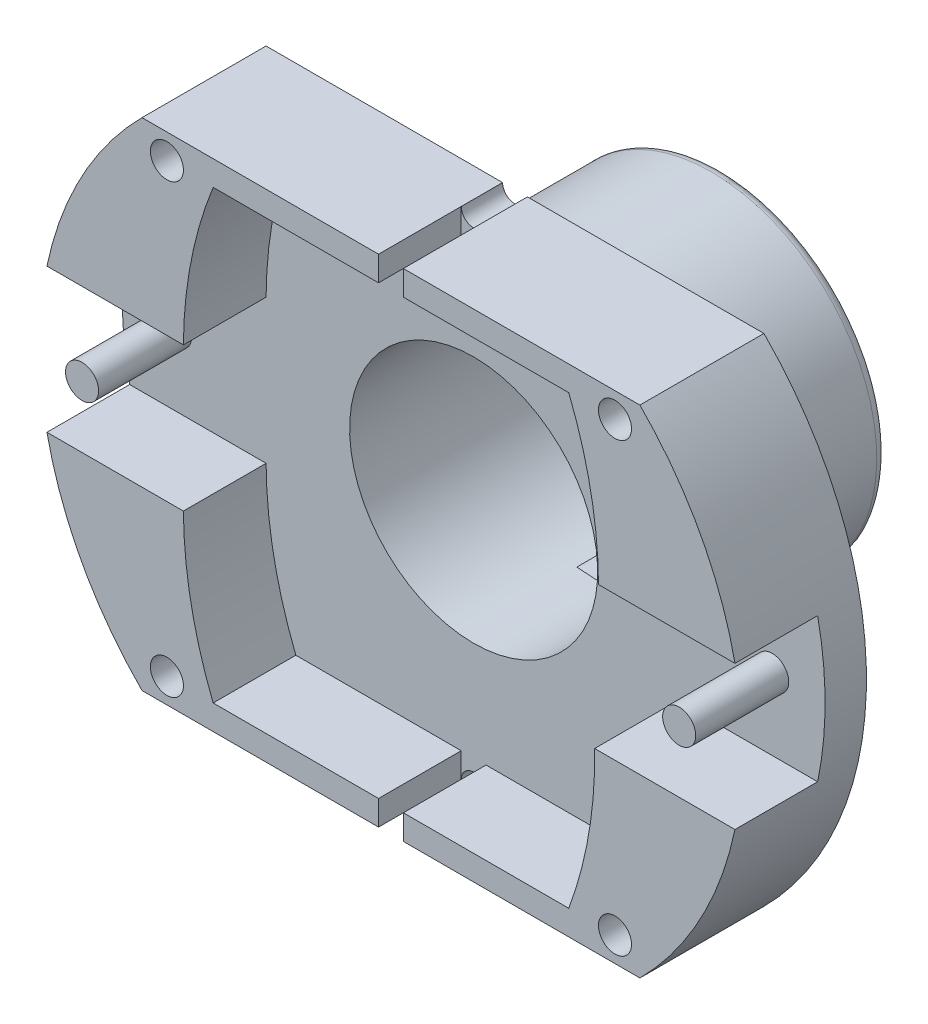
ISO-10303-21;
HEADER;
FILE_DESCRIPTION(('STEP AP214'),'2;1');
FILE_NAME('part.step','',(''),(''),'','','');
FILE_SCHEMA(('AUTOMOTIVE_DESIGN { 1 0 10303 214 1 1 1 1 }'));
ENDSEC;
DATA;
#1=APPLICATION_CONTEXT('core data for automotive mechanical design processes');
#2=APPLICATION_PROTOCOL_DEFINITION('international standard','automotive_design',2000,#1);
#3=PRODUCT_CONTEXT('',#1,'mechanical');
#4=PRODUCT('Part','Part','',(#3));
#5=PRODUCT_RELATED_PRODUCT_CATEGORY('part','',(#4));
#6=PRODUCT_DEFINITION_FORMATION('','',#4);
#7=PRODUCT_DEFINITION_CONTEXT('part definition',#1,'design');
#8=PRODUCT_DEFINITION('design','',#6,#7);
#9=PRODUCT_DEFINITION_SHAPE('','',#8);
#10=(LENGTH_UNIT() NAMED_UNIT(*) SI_UNIT(.MILLI.,.METRE.));
#11=(NAMED_UNIT(*) PLANE_ANGLE_UNIT() SI_UNIT($,.RADIAN.));
#12=(NAMED_UNIT(*) SI_UNIT($,.STERADIAN.) SOLID_ANGLE_UNIT());
#13=UNCERTAINTY_MEASURE_WITH_UNIT(LENGTH_MEASURE(1.E-05),#10,'distance_accuracy_value','');
#14=(GEOMETRIC_REPRESENTATION_CONTEXT(3) GLOBAL_UNCERTAINTY_ASSIGNED_CONTEXT((#13)) GLOBAL_UNIT_ASSIGNED_CONTEXT((#10,
#11,#12)) REPRESENTATION_CONTEXT('',''));
#15=CARTESIAN_POINT('',(0.,0.,0.));
#16=DIRECTION('',(0.,0.,1.));
#17=DIRECTION('',(1.,0.,0.));
#18=AXIS2_PLACEMENT_3D('',#15,#16,#17);
#19=CARTESIAN_POINT('',(-52.9982936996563,31.8784246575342,0.));
#20=DIRECTION('',(0.,0.,1.));
#21=DIRECTION('',(1.,0.,0.));
#22=AXIS2_PLACEMENT_3D('',#19,#20,#21);
#23=PLANE('',#22);
#24=CARTESIAN_POINT('',(-52.9982936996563,31.8784246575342,0.));
#25=DIRECTION('',(0.,0.,1.));
#26=DIRECTION('',(1.,0.,0.));
#27=AXIS2_PLACEMENT_3D('',#24,#25,#26);
#28=CIRCLE('',#27,8.5);
#29=CARTESIAN_POINT('',(-46.9774964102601,25.8784246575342,0.));
#30=VERTEX_POINT('',#29);
#31=CARTESIAN_POINT('',(-46.9774964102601,37.8784246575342,0.));
#32=VERTEX_POINT('',#31);
#33=EDGE_CURVE('E340',#30,#32,#28,.T.);
#34=ORIENTED_EDGE('',*,*,#33,.F.);
#35=DIRECTION('',(1.,0.,0.));
#36=VECTOR('',#35,1.);
#37=CARTESIAN_POINT('',(-52.6982936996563,25.8784246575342,0.));
#38=LINE('',#37,#36);
#39=CARTESIAN_POINT('',(-52.6982936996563,25.8784246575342,0.));
#40=VERTEX_POINT('',#39);
#41=EDGE_CURVE('E369',#40,#30,#38,.T.);
#42=ORIENTED_EDGE('',*,*,#41,.F.);
#43=CARTESIAN_POINT('',(-52.9982936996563,25.8784246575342,0.));
#44=DIRECTION('',(0.,0.,-1.));
#45=DIRECTION('',(1.,0.,0.));
#46=AXIS2_PLACEMENT_3D('',#43,#44,#45);
#47=CIRCLE('',#46,0.300000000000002);
#48=CARTESIAN_POINT('',(-53.2982936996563,25.8784246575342,0.));
#49=VERTEX_POINT('',#48);
#50=EDGE_CURVE('E367',#49,#40,#47,.T.);
#51=ORIENTED_EDGE('',*,*,#50,.F.);
#52=DIRECTION('',(1.,0.,0.));
#53=VECTOR('',#52,1.);
#54=CARTESIAN_POINT('',(-59.0190909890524,25.8784246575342,0.));
#55=LINE('',#54,#53);
#56=CARTESIAN_POINT('',(-59.0190909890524,25.8784246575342,0.));
#57=VERTEX_POINT('',#56);
#58=EDGE_CURVE('E365',#57,#49,#55,.T.);
#59=ORIENTED_EDGE('',*,*,#58,.F.);
#60=CARTESIAN_POINT('',(-52.9982936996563,31.8784246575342,0.));
#61=DIRECTION('',(0.,0.,1.));
#62=DIRECTION('',(1.,0.,0.));
#63=AXIS2_PLACEMENT_3D('',#60,#61,#62);
#64=CIRCLE('',#63,8.5);
#65=CARTESIAN_POINT('',(-59.0190909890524,37.8784246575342,0.));
#66=VERTEX_POINT('',#65);
#67=EDGE_CURVE('E363',#66,#57,#64,.T.);
#68=ORIENTED_EDGE('',*,*,#67,.F.);
#69=DIRECTION('',(-1.,0.,0.));
#70=VECTOR('',#69,1.);
#71=CARTESIAN_POINT('',(-59.0190909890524,37.8784246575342,0.));
#72=LINE('',#71,#70);
#73=CARTESIAN_POINT('',(-53.2982936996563,37.8784246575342,0.));
#74=VERTEX_POINT('',#73);
#75=EDGE_CURVE('E361',#74,#66,#72,.T.);
#76=ORIENTED_EDGE('',*,*,#75,.F.);
#77=CARTESIAN_POINT('',(-52.9982936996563,37.8784246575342,0.));
#78=DIRECTION('',(0.,0.,-1.));
#79=DIRECTION('',(1.,0.,0.));
#80=AXIS2_PLACEMENT_3D('',#77,#78,#79);
#81=CIRCLE('',#80,0.300000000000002);
#82=CARTESIAN_POINT('',(-52.6982936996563,37.8784246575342,0.));
#83=VERTEX_POINT('',#82);
#84=EDGE_CURVE('E351',#83,#74,#81,.T.);
#85=ORIENTED_EDGE('',*,*,#84,.F.);
#86=DIRECTION('',(-1.,0.,0.));
#87=VECTOR('',#86,1.);
#88=CARTESIAN_POINT('',(-52.6982936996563,37.8784246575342,0.));
#89=LINE('',#88,#87);
#90=EDGE_CURVE('E348',#32,#83,#89,.T.);
#91=ORIENTED_EDGE('',*,*,#90,.F.);
#92=EDGE_LOOP('',(#34,#42,#51,#59,#68,#76,#85,#91));
#93=FACE_BOUND('',#92,.T.);
#94=CARTESIAN_POINT('',(-52.9982936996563,31.8784246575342,0.));
#95=DIRECTION('',(0.,0.,1.));
#96=DIRECTION('',(1.,0.,0.));
#97=AXIS2_PLACEMENT_3D('',#94,#95,#96);
#98=CIRCLE('',#97,4.00000000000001);
#99=CARTESIAN_POINT('',(-48.9982936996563,31.8784246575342,0.));
#100=VERTEX_POINT('',#99);
#101=EDGE_CURVE('E798',#100,#100,#98,.F.);
#102=ORIENTED_EDGE('',*,*,#101,.F.);
#103=EDGE_LOOP('',(#102));
#104=FACE_BOUND('',#103,.T.);
#105=ADVANCED_FACE('F37',(#93,#104),#23,.F.);
#106=CARTESIAN_POINT('',(-52.9982936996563,31.8784246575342,1.));
#107=DIRECTION('',(0.,0.,1.));
#108=DIRECTION('',(1.,0.,0.));
#109=AXIS2_PLACEMENT_3D('',#106,#107,#108);
#110=PLANE('',#109);
#111=CARTESIAN_POINT('',(-52.9982936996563,31.8784246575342,1.));
#112=DIRECTION('',(0.,0.,1.));
#113=DIRECTION('',(1.,0.,0.));
#114=AXIS2_PLACEMENT_3D('',#111,#112,#113);
#115=CIRCLE('',#114,3.);
#116=CARTESIAN_POINT('',(-50.004181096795,31.6905690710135,1.));
#117=VERTEX_POINT('',#116);
#118=EDGE_CURVE('E247',#117,#117,#115,.F.);
#119=ORIENTED_EDGE('',*,*,#118,.T.);
#120=EDGE_LOOP('',(#119));
#121=FACE_BOUND('',#120,.T.);
#122=CARTESIAN_POINT('',(-45.7774964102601,31.8784246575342,1.));
#123=DIRECTION('',(0.,0.,1.));
#124=DIRECTION('',(1.,0.,0.));
#125=AXIS2_PLACEMENT_3D('',#122,#123,#124);
#126=CIRCLE('',#125,0.399999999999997);
#127=CARTESIAN_POINT('',(-45.3774964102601,31.8784246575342,1.));
#128=VERTEX_POINT('',#127);
#129=EDGE_CURVE('E569',#128,#128,#126,.T.);
#130=ORIENTED_EDGE('',*,*,#129,.F.);
#131=EDGE_LOOP('',(#130));
#132=FACE_BOUND('',#131,.T.);
#133=CARTESIAN_POINT('',(-58.0704214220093,29.9660057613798,1.));
#134=DIRECTION('',(0.,0.,-1.));
#135=DIRECTION('',(1.,0.,0.));
#136=AXIS2_PLACEMENT_3D('',#133,#134,#135);
#137=CIRCLE('',#136,10.);
#138=CARTESIAN_POINT('',(-48.0719079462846,30.1384246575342,1.));
#139=VERTEX_POINT('',#138);
#140=CARTESIAN_POINT('',(-48.6982936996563,26.4784246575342,1.));
#141=VERTEX_POINT('',#140);
#142=EDGE_CURVE('E62',#139,#141,#137,.T.);
#143=ORIENTED_EDGE('',*,*,#142,.F.);
#144=DIRECTION('',(-1.,0.,0.));
#145=VECTOR('',#144,1.);
#146=CARTESIAN_POINT('',(-44.6782936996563,30.1384246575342,1.));
#147=LINE('',#146,#145);
#148=CARTESIAN_POINT('',(-44.6782936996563,30.1384246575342,1.));
#149=VERTEX_POINT('',#148);
#150=EDGE_CURVE('E552',#149,#139,#147,.T.);
#151=ORIENTED_EDGE('',*,*,#150,.F.);
#152=CARTESIAN_POINT('',(-52.9982936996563,31.8784246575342,1.));
#153=DIRECTION('',(0.,0.,1.));
#154=DIRECTION('',(1.,0.,0.));
#155=AXIS2_PLACEMENT_3D('',#152,#153,#154);
#156=CIRCLE('',#155,8.5);
#157=CARTESIAN_POINT('',(-44.6782936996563,33.6184246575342,1.));
#158=VERTEX_POINT('',#157);
#159=EDGE_CURVE('E371',#149,#158,#156,.T.);
#160=ORIENTED_EDGE('',*,*,#159,.T.);
#161=DIRECTION('',(1.,0.,0.));
#162=VECTOR('',#161,1.);
#163=CARTESIAN_POINT('',(-44.6782936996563,33.6184246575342,1.));
#164=LINE('',#163,#162);
#165=CARTESIAN_POINT('',(-47.9782936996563,33.6184246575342,1.));
#166=VERTEX_POINT('',#165);
#167=EDGE_CURVE('E501',#166,#158,#164,.T.);
#168=ORIENTED_EDGE('',*,*,#167,.F.);
#169=CARTESIAN_POINT('',(-57.9780735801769,33.5520745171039,1.));
#170=DIRECTION('',(0.,0.,-1.));
#171=DIRECTION('',(-1.,0.,0.));
#172=AXIS2_PLACEMENT_3D('',#169,#170,#171);
#173=CIRCLE('',#172,10.);
#174=CARTESIAN_POINT('',(-48.6982936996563,37.2784246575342,1.));
#175=VERTEX_POINT('',#174);
#176=EDGE_CURVE('E505',#175,#166,#173,.T.);
#177=ORIENTED_EDGE('',*,*,#176,.F.);
#178=DIRECTION('',(1.,0.,0.));
#179=VECTOR('',#178,1.);
#180=CARTESIAN_POINT('',(-52.6982936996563,37.2784246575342,1.));
#181=LINE('',#180,#179);
#182=CARTESIAN_POINT('',(-52.6982936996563,37.2784246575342,1.));
#183=VERTEX_POINT('',#182);
#184=EDGE_CURVE('E508',#183,#175,#181,.T.);
#185=ORIENTED_EDGE('',*,*,#184,.F.);
#186=DIRECTION('',(0.,-1.,0.));
#187=VECTOR('',#186,1.);
#188=CARTESIAN_POINT('',(-52.6982936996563,37.8784246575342,1.));
#189=LINE('',#188,#187);
#190=CARTESIAN_POINT('',(-52.6982936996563,37.8784246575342,1.));
#191=VERTEX_POINT('',#190);
#192=EDGE_CURVE('E511',#191,#183,#189,.T.);
#193=ORIENTED_EDGE('',*,*,#192,.F.);
#194=CARTESIAN_POINT('',(-52.9982936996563,37.8784246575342,1.));
#195=DIRECTION('',(0.,0.,-1.));
#196=DIRECTION('',(1.,0.,0.));
#197=AXIS2_PLACEMENT_3D('',#194,#195,#196);
#198=CIRCLE('',#197,0.300000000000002);
#199=CARTESIAN_POINT('',(-53.2982936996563,37.8784246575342,1.));
#200=VERTEX_POINT('',#199);
#201=EDGE_CURVE('E395',#191,#200,#198,.T.);
#202=ORIENTED_EDGE('',*,*,#201,.T.);
#203=DIRECTION('',(0.,1.,0.));
#204=VECTOR('',#203,1.);
#205=CARTESIAN_POINT('',(-53.2982936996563,37.8784246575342,1.));
#206=LINE('',#205,#204);
#207=CARTESIAN_POINT('',(-53.2982936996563,37.2784246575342,1.));
#208=VERTEX_POINT('',#207);
#209=EDGE_CURVE('E414',#208,#200,#206,.T.);
#210=ORIENTED_EDGE('',*,*,#209,.F.);
#211=DIRECTION('',(1.,0.,0.));
#212=VECTOR('',#211,1.);
#213=CARTESIAN_POINT('',(-53.2982936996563,37.2784246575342,1.));
#214=LINE('',#213,#212);
#215=CARTESIAN_POINT('',(-57.2982936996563,37.2784246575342,1.));
#216=VERTEX_POINT('',#215);
#217=EDGE_CURVE('E418',#216,#208,#214,.T.);
#218=ORIENTED_EDGE('',*,*,#217,.F.);
#219=CARTESIAN_POINT('',(-48.0185138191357,33.552074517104,1.));
#220=DIRECTION('',(0.,0.,-1.));
#221=DIRECTION('',(-1.,0.,0.));
#222=AXIS2_PLACEMENT_3D('',#219,#220,#221);
#223=CIRCLE('',#222,9.99999999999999);
#224=CARTESIAN_POINT('',(-58.0182936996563,33.6184246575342,1.));
#225=VERTEX_POINT('',#224);
#226=EDGE_CURVE('E421',#225,#216,#223,.T.);
#227=ORIENTED_EDGE('',*,*,#226,.F.);
#228=DIRECTION('',(1.,0.,0.));
#229=VECTOR('',#228,1.);
#230=CARTESIAN_POINT('',(-61.3182936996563,33.6184246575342,1.));
#231=LINE('',#230,#229);
#232=CARTESIAN_POINT('',(-61.3182936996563,33.6184246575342,1.));
#233=VERTEX_POINT('',#232);
#234=EDGE_CURVE('E396',#233,#225,#231,.T.);
#235=ORIENTED_EDGE('',*,*,#234,.F.);
#236=CARTESIAN_POINT('',(-52.9982936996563,31.8784246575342,1.));
#237=DIRECTION('',(0.,0.,1.));
#238=DIRECTION('',(1.,0.,0.));
#239=AXIS2_PLACEMENT_3D('',#236,#237,#238);
#240=CIRCLE('',#239,8.5);
#241=CARTESIAN_POINT('',(-61.3182936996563,30.1384246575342,1.));
#242=VERTEX_POINT('',#241);
#243=EDGE_CURVE('E393',#233,#242,#240,.T.);
#244=ORIENTED_EDGE('',*,*,#243,.T.);
#245=DIRECTION('',(-1.,0.,0.));
#246=VECTOR('',#245,1.);
#247=CARTESIAN_POINT('',(-61.3182936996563,30.1384246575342,1.));
#248=LINE('',#247,#246);
#249=CARTESIAN_POINT('',(-58.0182936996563,30.1384246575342,1.));
#250=VERTEX_POINT('',#249);
#251=EDGE_CURVE('E458',#250,#242,#248,.T.);
#252=ORIENTED_EDGE('',*,*,#251,.F.);
#253=CARTESIAN_POINT('',(-48.0185138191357,30.2047747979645,1.));
#254=DIRECTION('',(0.,0.,-1.));
#255=DIRECTION('',(1.,0.,0.));
#256=AXIS2_PLACEMENT_3D('',#253,#254,#255);
#257=CIRCLE('',#256,9.99999999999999);
#258=CARTESIAN_POINT('',(-57.2982936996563,26.4784246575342,1.));
#259=VERTEX_POINT('',#258);
#260=EDGE_CURVE('E462',#259,#250,#257,.T.);
#261=ORIENTED_EDGE('',*,*,#260,.F.);
#262=DIRECTION('',(-1.,0.,0.));
#263=VECTOR('',#262,1.);
#264=CARTESIAN_POINT('',(-53.2982936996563,26.4784246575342,1.));
#265=LINE('',#264,#263);
#266=CARTESIAN_POINT('',(-53.2982936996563,26.4784246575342,1.));
#267=VERTEX_POINT('',#266);
#268=EDGE_CURVE('E465',#267,#259,#265,.T.);
#269=ORIENTED_EDGE('',*,*,#268,.F.);
#270=DIRECTION('',(0.,1.,0.));
#271=VECTOR('',#270,1.);
#272=CARTESIAN_POINT('',(-53.2982936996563,25.8784246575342,1.));
#273=LINE('',#272,#271);
#274=CARTESIAN_POINT('',(-53.2982936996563,25.8784246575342,1.));
#275=VERTEX_POINT('',#274);
#276=EDGE_CURVE('E468',#275,#267,#273,.T.);
#277=ORIENTED_EDGE('',*,*,#276,.F.);
#278=CARTESIAN_POINT('',(-52.9982936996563,25.8784246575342,1.));
#279=DIRECTION('',(0.,0.,-1.));
#280=DIRECTION('',(1.,0.,0.));
#281=AXIS2_PLACEMENT_3D('',#278,#279,#280);
#282=CIRCLE('',#281,0.300000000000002);
#283=CARTESIAN_POINT('',(-52.6982936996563,25.8784246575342,1.));
#284=VERTEX_POINT('',#283);
#285=EDGE_CURVE('E357',#275,#284,#282,.T.);
#286=ORIENTED_EDGE('',*,*,#285,.T.);
#287=DIRECTION('',(0.,-1.,0.));
#288=VECTOR('',#287,1.);
#289=CARTESIAN_POINT('',(-52.6982936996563,25.8784246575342,1.));
#290=LINE('',#289,#288);
#291=CARTESIAN_POINT('',(-52.6982936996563,26.4784246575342,1.));
#292=VERTEX_POINT('',#291);
#293=EDGE_CURVE('E544',#292,#284,#290,.T.);
#294=ORIENTED_EDGE('',*,*,#293,.F.);
#295=DIRECTION('',(-1.,0.,0.));
#296=VECTOR('',#295,1.);
#297=CARTESIAN_POINT('',(-52.6982936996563,26.4784246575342,1.));
#298=LINE('',#297,#296);
#299=EDGE_CURVE('E548',#141,#292,#298,.T.);
#300=ORIENTED_EDGE('',*,*,#299,.F.);
#301=EDGE_LOOP('',(#143,#151,#160,#168,#177,#185,#193,#202,#210,#218,#227,#235,#244,#252,#261,
#269,#277,#286,#294,#300));
#302=FACE_BOUND('',#301,.T.);
#303=CARTESIAN_POINT('',(-60.2190909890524,31.8784246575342,1.));
#304=DIRECTION('',(0.,0.,1.));
#305=DIRECTION('',(1.,0.,0.));
#306=AXIS2_PLACEMENT_3D('',#303,#304,#305);
#307=CIRCLE('',#306,0.399999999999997);
#308=CARTESIAN_POINT('',(-59.8190909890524,31.8784246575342,1.));
#309=VERTEX_POINT('',#308);
#310=EDGE_CURVE('E572',#309,#309,#307,.T.);
#311=ORIENTED_EDGE('',*,*,#310,.F.);
#312=EDGE_LOOP('',(#311));
#313=FACE_BOUND('',#312,.T.);
#314=ADVANCED_FACE('F290',(#121,#132,#302,#313),#110,.T.);
#315=CARTESIAN_POINT('',(-52.9982936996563,31.8784246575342,1.));
#316=DIRECTION('',(0.,0.,-1.));
#317=DIRECTION('',(-1.,0.,0.));
#318=AXIS2_PLACEMENT_3D('',#315,#316,#317);
#319=CYLINDRICAL_SURFACE('',#318,8.5);
#320=ORIENTED_EDGE('',*,*,#33,.T.);
#321=DIRECTION('',(0.,0.,-1.));
#322=VECTOR('',#321,1.);
#323=CARTESIAN_POINT('',(-46.9774964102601,37.8784246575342,1.));
#324=LINE('',#323,#322);
#325=CARTESIAN_POINT('',(-46.9774964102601,37.8784246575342,3.));
#326=VERTEX_POINT('',#325);
#327=EDGE_CURVE('E343',#326,#32,#324,.T.);
#328=ORIENTED_EDGE('',*,*,#327,.F.);
#329=CARTESIAN_POINT('',(-52.9982936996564,31.8784246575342,3.));
#330=DIRECTION('',(0.,0.,1.));
#331=DIRECTION('',(-1.,0.,0.));
#332=AXIS2_PLACEMENT_3D('',#329,#330,#331);
#333=CIRCLE('',#332,8.5000000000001);
#334=CARTESIAN_POINT('',(-44.6782936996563,33.6184246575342,3.));
#335=VERTEX_POINT('',#334);
#336=EDGE_CURVE('E504',#335,#326,#333,.T.);
#337=ORIENTED_EDGE('',*,*,#336,.F.);
#338=DIRECTION('',(0.,0.,-1.));
#339=VECTOR('',#338,1.);
#340=CARTESIAN_POINT('',(-44.6782936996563,33.6184246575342,3.));
#341=LINE('',#340,#339);
#342=EDGE_CURVE('E497',#335,#158,#341,.T.);
#343=ORIENTED_EDGE('',*,*,#342,.T.);
#344=ORIENTED_EDGE('',*,*,#159,.F.);
#345=DIRECTION('',(0.,0.,-1.));
#346=VECTOR('',#345,1.);
#347=CARTESIAN_POINT('',(-44.6782936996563,30.1384246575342,3.));
#348=LINE('',#347,#346);
#349=CARTESIAN_POINT('',(-44.6782936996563,30.1384246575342,3.));
#350=VERTEX_POINT('',#349);
#351=EDGE_CURVE('E528',#350,#149,#348,.T.);
#352=ORIENTED_EDGE('',*,*,#351,.F.);
#353=CARTESIAN_POINT('',(-52.9982936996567,31.8784246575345,3.));
#354=DIRECTION('',(0.,0.,1.));
#355=DIRECTION('',(1.,0.,0.));
#356=AXIS2_PLACEMENT_3D('',#353,#354,#355);
#357=CIRCLE('',#356,8.50000000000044);
#358=CARTESIAN_POINT('',(-46.9774964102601,25.8784246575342,3.));
#359=VERTEX_POINT('',#358);
#360=EDGE_CURVE('E547',#359,#350,#357,.T.);
#361=ORIENTED_EDGE('',*,*,#360,.F.);
#362=DIRECTION('',(0.,0.,-1.));
#363=VECTOR('',#362,1.);
#364=CARTESIAN_POINT('',(-46.9774964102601,25.8784246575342,1.));
#365=LINE('',#364,#363);
#366=EDGE_CURVE('E346',#359,#30,#365,.T.);
#367=ORIENTED_EDGE('',*,*,#366,.T.);
#368=EDGE_LOOP('',(#320,#328,#337,#343,#344,#352,#361,#367));
#369=FACE_BOUND('',#368,.T.);
#370=ADVANCED_FACE('F296',(#369),#319,.T.);
#371=CARTESIAN_POINT('',(-52.6982936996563,37.8784246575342,1.));
#372=DIRECTION('',(0.,-1.,0.));
#373=DIRECTION('',(0.,0.,-1.));
#374=AXIS2_PLACEMENT_3D('',#371,#372,#373);
#375=PLANE('',#374);
#376=ORIENTED_EDGE('',*,*,#90,.T.);
#377=DIRECTION('',(0.,0.,-1.));
#378=VECTOR('',#377,1.);
#379=CARTESIAN_POINT('',(-52.6982936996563,37.8784246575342,1.));
#380=LINE('',#379,#378);
#381=EDGE_CURVE('E388',#191,#83,#380,.T.);
#382=ORIENTED_EDGE('',*,*,#381,.F.);
#383=DIRECTION('',(0.,0.,-1.));
#384=VECTOR('',#383,1.);
#385=CARTESIAN_POINT('',(-52.6982936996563,37.8784246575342,3.));
#386=LINE('',#385,#384);
#387=CARTESIAN_POINT('',(-52.6982936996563,37.8784246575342,3.));
#388=VERTEX_POINT('',#387);
#389=EDGE_CURVE('E485',#388,#191,#386,.T.);
#390=ORIENTED_EDGE('',*,*,#389,.F.);
#391=DIRECTION('',(-1.,0.,0.));
#392=VECTOR('',#391,1.);
#393=CARTESIAN_POINT('',(-52.6982936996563,37.8784246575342,3.));
#394=LINE('',#393,#392);
#395=EDGE_CURVE('E522',#326,#388,#394,.T.);
#396=ORIENTED_EDGE('',*,*,#395,.F.);
#397=ORIENTED_EDGE('',*,*,#327,.T.);
#398=EDGE_LOOP('',(#376,#382,#390,#396,#397));
#399=FACE_BOUND('',#398,.T.);
#400=ADVANCED_FACE('F330',(#399),#375,.F.);
#401=CARTESIAN_POINT('',(-52.9982936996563,37.8784246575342,1.));
#402=DIRECTION('',(0.,0.,-1.));
#403=DIRECTION('',(-1.,0.,0.));
#404=AXIS2_PLACEMENT_3D('',#401,#402,#403);
#405=CYLINDRICAL_SURFACE('',#404,0.300000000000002);
#406=ORIENTED_EDGE('',*,*,#84,.T.);
#407=DIRECTION('',(0.,0.,-1.));
#408=VECTOR('',#407,1.);
#409=CARTESIAN_POINT('',(-53.2982936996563,37.8784246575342,1.));
#410=LINE('',#409,#408);
#411=EDGE_CURVE('E385',#200,#74,#410,.T.);
#412=ORIENTED_EDGE('',*,*,#411,.F.);
#413=ORIENTED_EDGE('',*,*,#201,.F.);
#414=ORIENTED_EDGE('',*,*,#381,.T.);
#415=EDGE_LOOP('',(#406,#412,#413,#414));
#416=FACE_BOUND('',#415,.T.);
#417=ADVANCED_FACE('F326',(#416),#405,.F.);
#418=CARTESIAN_POINT('',(-59.0190909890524,37.8784246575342,1.));
#419=DIRECTION('',(0.,-1.,0.));
#420=DIRECTION('',(0.,0.,-1.));
#421=AXIS2_PLACEMENT_3D('',#418,#419,#420);
#422=PLANE('',#421);
#423=ORIENTED_EDGE('',*,*,#75,.T.);
#424=DIRECTION('',(0.,0.,-1.));
#425=VECTOR('',#424,1.);
#426=CARTESIAN_POINT('',(-59.0190909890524,37.8784246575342,1.));
#427=LINE('',#426,#425);
#428=CARTESIAN_POINT('',(-59.0190909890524,37.8784246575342,3.));
#429=VERTEX_POINT('',#428);
#430=EDGE_CURVE('E382',#429,#66,#427,.T.);
#431=ORIENTED_EDGE('',*,*,#430,.F.);
#432=DIRECTION('',(-1.,0.,0.));
#433=VECTOR('',#432,1.);
#434=CARTESIAN_POINT('',(-53.2982936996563,37.8784246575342,3.));
#435=LINE('',#434,#433);
#436=CARTESIAN_POINT('',(-53.2982936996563,37.8784246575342,3.));
#437=VERTEX_POINT('',#436);
#438=EDGE_CURVE('E413',#437,#429,#435,.T.);
#439=ORIENTED_EDGE('',*,*,#438,.F.);
#440=DIRECTION('',(0.,0.,-1.));
#441=VECTOR('',#440,1.);
#442=CARTESIAN_POINT('',(-53.2982936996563,37.8784246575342,3.));
#443=LINE('',#442,#441);
#444=EDGE_CURVE('E410',#437,#200,#443,.T.);
#445=ORIENTED_EDGE('',*,*,#444,.T.);
#446=ORIENTED_EDGE('',*,*,#411,.T.);
#447=EDGE_LOOP('',(#423,#431,#439,#445,#446));
#448=FACE_BOUND('',#447,.T.);
#449=ADVANCED_FACE('F322',(#448),#422,.F.);
#450=CARTESIAN_POINT('',(-52.9982936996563,31.8784246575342,1.));
#451=DIRECTION('',(0.,0.,-1.));
#452=DIRECTION('',(-1.,0.,0.));
#453=AXIS2_PLACEMENT_3D('',#450,#451,#452);
#454=CYLINDRICAL_SURFACE('',#453,8.5);
#455=ORIENTED_EDGE('',*,*,#67,.T.);
#456=DIRECTION('',(0.,0.,-1.));
#457=VECTOR('',#456,1.);
#458=CARTESIAN_POINT('',(-59.0190909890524,25.8784246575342,1.));
#459=LINE('',#458,#457);
#460=CARTESIAN_POINT('',(-59.0190909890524,25.8784246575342,3.));
#461=VERTEX_POINT('',#460);
#462=EDGE_CURVE('E379',#461,#57,#459,.T.);
#463=ORIENTED_EDGE('',*,*,#462,.F.);
#464=CARTESIAN_POINT('',(-52.9982936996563,31.8784246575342,3.));
#465=DIRECTION('',(0.,0.,1.));
#466=DIRECTION('',(-1.,0.,0.));
#467=AXIS2_PLACEMENT_3D('',#464,#465,#466);
#468=CIRCLE('',#467,8.5);
#469=CARTESIAN_POINT('',(-61.3182936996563,30.1384246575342,3.));
#470=VERTEX_POINT('',#469);
#471=EDGE_CURVE('E461',#470,#461,#468,.T.);
#472=ORIENTED_EDGE('',*,*,#471,.F.);
#473=DIRECTION('',(0.,0.,-1.));
#474=VECTOR('',#473,1.);
#475=CARTESIAN_POINT('',(-61.3182936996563,30.1384246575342,3.));
#476=LINE('',#475,#474);
#477=EDGE_CURVE('E454',#470,#242,#476,.T.);
#478=ORIENTED_EDGE('',*,*,#477,.T.);
#479=ORIENTED_EDGE('',*,*,#243,.F.);
#480=DIRECTION('',(0.,0.,-1.));
#481=VECTOR('',#480,1.);
#482=CARTESIAN_POINT('',(-61.3182936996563,33.6184246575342,3.));
#483=LINE('',#482,#481);
#484=CARTESIAN_POINT('',(-61.3182936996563,33.6184246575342,3.));
#485=VERTEX_POINT('',#484);
#486=EDGE_CURVE('E349',#485,#233,#483,.T.);
#487=ORIENTED_EDGE('',*,*,#486,.F.);
#488=CARTESIAN_POINT('',(-52.9982936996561,31.8784246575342,3.));
#489=DIRECTION('',(0.,0.,1.));
#490=DIRECTION('',(-1.,0.,0.));
#491=AXIS2_PLACEMENT_3D('',#488,#489,#490);
#492=CIRCLE('',#491,8.50000000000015);
#493=EDGE_CURVE('E417',#429,#485,#492,.T.);
#494=ORIENTED_EDGE('',*,*,#493,.F.);
#495=ORIENTED_EDGE('',*,*,#430,.T.);
#496=EDGE_LOOP('',(#455,#463,#472,#478,#479,#487,#494,#495));
#497=FACE_BOUND('',#496,.T.);
#498=ADVANCED_FACE('F318',(#497),#454,.T.);
#499=CARTESIAN_POINT('',(-59.0190909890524,25.8784246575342,1.));
#500=DIRECTION('',(0.,1.,0.));
#501=DIRECTION('',(0.,0.,1.));
#502=AXIS2_PLACEMENT_3D('',#499,#500,#501);
#503=PLANE('',#502);
#504=ORIENTED_EDGE('',*,*,#58,.T.);
#505=DIRECTION('',(0.,0.,-1.));
#506=VECTOR('',#505,1.);
#507=CARTESIAN_POINT('',(-53.2982936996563,25.8784246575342,1.));
#508=LINE('',#507,#506);
#509=EDGE_CURVE('E376',#275,#49,#508,.T.);
#510=ORIENTED_EDGE('',*,*,#509,.F.);
#511=DIRECTION('',(0.,0.,-1.));
#512=VECTOR('',#511,1.);
#513=CARTESIAN_POINT('',(-53.2982936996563,25.8784246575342,3.));
#514=LINE('',#513,#512);
#515=CARTESIAN_POINT('',(-53.2982936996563,25.8784246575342,3.));
#516=VERTEX_POINT('',#515);
#517=EDGE_CURVE('E440',#516,#275,#514,.T.);
#518=ORIENTED_EDGE('',*,*,#517,.F.);
#519=DIRECTION('',(1.,0.,0.));
#520=VECTOR('',#519,1.);
#521=CARTESIAN_POINT('',(-53.2982936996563,25.8784246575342,3.));
#522=LINE('',#521,#520);
#523=EDGE_CURVE('E479',#461,#516,#522,.T.);
#524=ORIENTED_EDGE('',*,*,#523,.F.);
#525=ORIENTED_EDGE('',*,*,#462,.T.);
#526=EDGE_LOOP('',(#504,#510,#518,#524,#525));
#527=FACE_BOUND('',#526,.T.);
#528=ADVANCED_FACE('F314',(#527),#503,.F.);
#529=CARTESIAN_POINT('',(-52.9982936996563,25.8784246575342,1.));
#530=DIRECTION('',(0.,0.,-1.));
#531=DIRECTION('',(-1.,0.,0.));
#532=AXIS2_PLACEMENT_3D('',#529,#530,#531);
#533=CYLINDRICAL_SURFACE('',#532,0.300000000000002);
#534=ORIENTED_EDGE('',*,*,#50,.T.);
#535=DIRECTION('',(0.,0.,-1.));
#536=VECTOR('',#535,1.);
#537=CARTESIAN_POINT('',(-52.6982936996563,25.8784246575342,1.));
#538=LINE('',#537,#536);
#539=EDGE_CURVE('E373',#284,#40,#538,.T.);
#540=ORIENTED_EDGE('',*,*,#539,.F.);
#541=ORIENTED_EDGE('',*,*,#285,.F.);
#542=ORIENTED_EDGE('',*,*,#509,.T.);
#543=EDGE_LOOP('',(#534,#540,#541,#542));
#544=FACE_BOUND('',#543,.T.);
#545=ADVANCED_FACE('F310',(#544),#533,.F.);
#546=CARTESIAN_POINT('',(-52.6982936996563,25.8784246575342,1.));
#547=DIRECTION('',(0.,1.,0.));
#548=DIRECTION('',(0.,0.,1.));
#549=AXIS2_PLACEMENT_3D('',#546,#547,#548);
#550=PLANE('',#549);
#551=ORIENTED_EDGE('',*,*,#41,.T.);
#552=ORIENTED_EDGE('',*,*,#366,.F.);
#553=DIRECTION('',(1.,0.,0.));
#554=VECTOR('',#553,1.);
#555=CARTESIAN_POINT('',(-52.6982936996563,25.8784246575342,3.));
#556=LINE('',#555,#554);
#557=CARTESIAN_POINT('',(-52.6982936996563,25.8784246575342,3.));
#558=VERTEX_POINT('',#557);
#559=EDGE_CURVE('E543',#558,#359,#556,.T.);
#560=ORIENTED_EDGE('',*,*,#559,.F.);
#561=DIRECTION('',(0.,0.,-1.));
#562=VECTOR('',#561,1.);
#563=CARTESIAN_POINT('',(-52.6982936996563,25.8784246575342,3.));
#564=LINE('',#563,#562);
#565=EDGE_CURVE('E540',#558,#284,#564,.T.);
#566=ORIENTED_EDGE('',*,*,#565,.T.);
#567=ORIENTED_EDGE('',*,*,#539,.T.);
#568=EDGE_LOOP('',(#551,#552,#560,#566,#567));
#569=FACE_BOUND('',#568,.T.);
#570=ADVANCED_FACE('F306',(#569),#550,.F.);
#571=CARTESIAN_POINT('',(-52.9982936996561,31.8784246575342,3.));
#572=DIRECTION('',(0.,0.,-1.));
#573=DIRECTION('',(-1.,0.,0.));
#574=AXIS2_PLACEMENT_3D('',#571,#572,#573);
#575=PLANE('',#574);
#576=ORIENTED_EDGE('',*,*,#493,.T.);
#577=DIRECTION('',(1.,0.,0.));
#578=VECTOR('',#577,1.);
#579=CARTESIAN_POINT('',(-61.3182936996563,33.6184246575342,3.));
#580=LINE('',#579,#578);
#581=CARTESIAN_POINT('',(-58.0182936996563,33.6184246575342,3.));
#582=VERTEX_POINT('',#581);
#583=EDGE_CURVE('E432',#485,#582,#580,.T.);
#584=ORIENTED_EDGE('',*,*,#583,.T.);
#585=CARTESIAN_POINT('',(-48.0185138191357,33.552074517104,3.));
#586=DIRECTION('',(0.,0.,-1.));
#587=DIRECTION('',(-1.,0.,0.));
#588=AXIS2_PLACEMENT_3D('',#585,#586,#587);
#589=CIRCLE('',#588,9.99999999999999);
#590=CARTESIAN_POINT('',(-57.2982936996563,37.2784246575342,3.));
#591=VERTEX_POINT('',#590);
#592=EDGE_CURVE('E430',#582,#591,#589,.T.);
#593=ORIENTED_EDGE('',*,*,#592,.T.);
#594=DIRECTION('',(1.,0.,0.));
#595=VECTOR('',#594,1.);
#596=CARTESIAN_POINT('',(-53.2982936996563,37.2784246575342,3.));
#597=LINE('',#596,#595);
#598=CARTESIAN_POINT('',(-53.2982936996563,37.2784246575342,3.));
#599=VERTEX_POINT('',#598);
#600=EDGE_CURVE('E428',#591,#599,#597,.T.);
#601=ORIENTED_EDGE('',*,*,#600,.T.);
#602=DIRECTION('',(0.,1.,0.));
#603=VECTOR('',#602,1.);
#604=CARTESIAN_POINT('',(-53.2982936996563,37.8784246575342,3.));
#605=LINE('',#604,#603);
#606=EDGE_CURVE('E426',#599,#437,#605,.T.);
#607=ORIENTED_EDGE('',*,*,#606,.T.);
#608=ORIENTED_EDGE('',*,*,#438,.T.);
#609=EDGE_LOOP('',(#576,#584,#593,#601,#607,#608));
#610=FACE_BOUND('',#609,.T.);
#611=CARTESIAN_POINT('',(-58.4170112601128,37.2784246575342,3.));
#612=DIRECTION('',(0.,0.,1.));
#613=DIRECTION('',(1.,0.,0.));
#614=AXIS2_PLACEMENT_3D('',#611,#612,#613);
#615=CIRCLE('',#614,0.399999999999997);
#616=CARTESIAN_POINT('',(-58.0170112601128,37.2784246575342,3.));
#617=VERTEX_POINT('',#616);
#618=EDGE_CURVE('E439',#617,#617,#615,.T.);
#619=ORIENTED_EDGE('',*,*,#618,.F.);
#620=EDGE_LOOP('',(#619));
#621=FACE_BOUND('',#620,.T.);
#622=ADVANCED_FACE('F309',(#610,#621),#575,.F.);
#623=CARTESIAN_POINT('',(-61.3182936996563,33.6184246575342,3.));
#624=DIRECTION('',(0.,1.,0.));
#625=DIRECTION('',(0.,0.,1.));
#626=AXIS2_PLACEMENT_3D('',#623,#624,#625);
#627=PLANE('',#626);
#628=ORIENTED_EDGE('',*,*,#234,.T.);
#629=DIRECTION('',(0.,0.,-1.));
#630=VECTOR('',#629,1.);
#631=CARTESIAN_POINT('',(-58.0182936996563,33.6184246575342,3.));
#632=LINE('',#631,#630);
#633=EDGE_CURVE('E354',#582,#225,#632,.T.);
#634=ORIENTED_EDGE('',*,*,#633,.F.);
#635=ORIENTED_EDGE('',*,*,#583,.F.);
#636=ORIENTED_EDGE('',*,*,#486,.T.);
#637=EDGE_LOOP('',(#628,#634,#635,#636));
#638=FACE_BOUND('',#637,.T.);
#639=ADVANCED_FACE('F709',(#638),#627,.F.);
#640=CARTESIAN_POINT('',(-48.0185138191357,33.552074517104,3.));
#641=DIRECTION('',(0.,0.,-1.));
#642=DIRECTION('',(-1.,0.,0.));
#643=AXIS2_PLACEMENT_3D('',#640,#641,#642);
#644=CYLINDRICAL_SURFACE('',#643,9.99999999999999);
#645=ORIENTED_EDGE('',*,*,#226,.T.);
#646=DIRECTION('',(0.,0.,-1.));
#647=VECTOR('',#646,1.);
#648=CARTESIAN_POINT('',(-57.2982936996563,37.2784246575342,3.));
#649=LINE('',#648,#647);
#650=EDGE_CURVE('E404',#591,#216,#649,.T.);
#651=ORIENTED_EDGE('',*,*,#650,.F.);
#652=ORIENTED_EDGE('',*,*,#592,.F.);
#653=ORIENTED_EDGE('',*,*,#633,.T.);
#654=EDGE_LOOP('',(#645,#651,#652,#653));
#655=FACE_BOUND('',#654,.T.);
#656=ADVANCED_FACE('F717',(#655),#644,.F.);
#657=CARTESIAN_POINT('',(-53.2982936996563,37.2784246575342,3.));
#658=DIRECTION('',(0.,1.,0.));
#659=DIRECTION('',(0.,0.,1.));
#660=AXIS2_PLACEMENT_3D('',#657,#658,#659);
#661=PLANE('',#660);
#662=ORIENTED_EDGE('',*,*,#217,.T.);
#663=DIRECTION('',(0.,0.,-1.));
#664=VECTOR('',#663,1.);
#665=CARTESIAN_POINT('',(-53.2982936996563,37.2784246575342,3.));
#666=LINE('',#665,#664);
#667=EDGE_CURVE('E407',#599,#208,#666,.T.);
#668=ORIENTED_EDGE('',*,*,#667,.F.);
#669=ORIENTED_EDGE('',*,*,#600,.F.);
#670=ORIENTED_EDGE('',*,*,#650,.T.);
#671=EDGE_LOOP('',(#662,#668,#669,#670));
#672=FACE_BOUND('',#671,.T.);
#673=ADVANCED_FACE('F713',(#672),#661,.F.);
#674=CARTESIAN_POINT('',(-53.2982936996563,37.8784246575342,3.));
#675=DIRECTION('',(-1.,0.,0.));
#676=DIRECTION('',(0.,0.,1.));
#677=AXIS2_PLACEMENT_3D('',#674,#675,#676);
#678=PLANE('',#677);
#679=ORIENTED_EDGE('',*,*,#209,.T.);
#680=ORIENTED_EDGE('',*,*,#444,.F.);
#681=ORIENTED_EDGE('',*,*,#606,.F.);
#682=ORIENTED_EDGE('',*,*,#667,.T.);
#683=EDGE_LOOP('',(#679,#680,#681,#682));
#684=FACE_BOUND('',#683,.T.);
#685=ADVANCED_FACE('F705',(#684),#678,.F.);
#686=CARTESIAN_POINT('',(-58.4170112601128,37.2784246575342,3.));
#687=DIRECTION('',(0.,0.,-1.));
#688=DIRECTION('',(-1.,0.,0.));
#689=AXIS2_PLACEMENT_3D('',#686,#687,#688);
#690=CYLINDRICAL_SURFACE('',#689,0.399999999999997);
#691=ORIENTED_EDGE('',*,*,#618,.T.);
#692=EDGE_LOOP('',(#691));
#693=FACE_BOUND('',#692,.T.);
#694=CARTESIAN_POINT('',(-58.4170112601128,37.2784246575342,1.));
#695=DIRECTION('',(0.,0.,1.));
#696=DIRECTION('',(1.,0.,0.));
#697=AXIS2_PLACEMENT_3D('',#694,#695,#696);
#698=CIRCLE('',#697,0.399999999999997);
#699=CARTESIAN_POINT('',(-58.0170112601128,37.2784246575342,1.));
#700=VERTEX_POINT('',#699);
#701=EDGE_CURVE('E436',#700,#700,#698,.T.);
#702=ORIENTED_EDGE('',*,*,#701,.F.);
#703=EDGE_LOOP('',(#702));
#704=FACE_BOUND('',#703,.T.);
#705=ADVANCED_FACE('F702',(#693,#704),#690,.F.);
#706=ORIENTED_EDGE('',*,*,#701,.T.);
#707=EDGE_LOOP('',(#706));
#708=FACE_BOUND('',#707,.T.);
#709=ADVANCED_FACE('F686',(#708),#110,.T.);
#710=CARTESIAN_POINT('',(-52.9982936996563,31.8784246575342,3.));
#711=DIRECTION('',(0.,0.,-1.));
#712=DIRECTION('',(-1.,0.,0.));
#713=AXIS2_PLACEMENT_3D('',#710,#711,#712);
#714=PLANE('',#713);
#715=ORIENTED_EDGE('',*,*,#471,.T.);
#716=ORIENTED_EDGE('',*,*,#523,.T.);
#717=DIRECTION('',(0.,1.,0.));
#718=VECTOR('',#717,1.);
#719=CARTESIAN_POINT('',(-53.2982936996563,25.8784246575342,3.));
#720=LINE('',#719,#718);
#721=CARTESIAN_POINT('',(-53.2982936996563,26.4784246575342,3.));
#722=VERTEX_POINT('',#721);
#723=EDGE_CURVE('E477',#516,#722,#720,.T.);
#724=ORIENTED_EDGE('',*,*,#723,.T.);
#725=DIRECTION('',(-1.,0.,0.));
#726=VECTOR('',#725,1.);
#727=CARTESIAN_POINT('',(-53.2982936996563,26.4784246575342,3.));
#728=LINE('',#727,#726);
#729=CARTESIAN_POINT('',(-57.2982936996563,26.4784246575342,3.));
#730=VERTEX_POINT('',#729);
#731=EDGE_CURVE('E475',#722,#730,#728,.T.);
#732=ORIENTED_EDGE('',*,*,#731,.T.);
#733=CARTESIAN_POINT('',(-48.0185138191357,30.2047747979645,3.));
#734=DIRECTION('',(0.,0.,-1.));
#735=DIRECTION('',(1.,0.,0.));
#736=AXIS2_PLACEMENT_3D('',#733,#734,#735);
#737=CIRCLE('',#736,9.99999999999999);
#738=CARTESIAN_POINT('',(-58.0182936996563,30.1384246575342,3.));
#739=VERTEX_POINT('',#738);
#740=EDGE_CURVE('E473',#730,#739,#737,.T.);
#741=ORIENTED_EDGE('',*,*,#740,.T.);
#742=DIRECTION('',(-1.,0.,0.));
#743=VECTOR('',#742,1.);
#744=CARTESIAN_POINT('',(-61.3182936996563,30.1384246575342,3.));
#745=LINE('',#744,#743);
#746=EDGE_CURVE('E457',#739,#470,#745,.T.);
#747=ORIENTED_EDGE('',*,*,#746,.T.);
#748=EDGE_LOOP('',(#715,#716,#724,#732,#741,#747));
#749=FACE_BOUND('',#748,.T.);
#750=CARTESIAN_POINT('',(-58.4170112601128,26.4784246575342,3.));
#751=DIRECTION('',(0.,0.,1.));
#752=DIRECTION('',(1.,0.,0.));
#753=AXIS2_PLACEMENT_3D('',#750,#751,#752);
#754=CIRCLE('',#753,0.399999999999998);
#755=CARTESIAN_POINT('',(-58.0170112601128,26.4784246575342,3.));
#756=VERTEX_POINT('',#755);
#757=EDGE_CURVE('E471',#756,#756,#754,.T.);
#758=ORIENTED_EDGE('',*,*,#757,.F.);
#759=EDGE_LOOP('',(#758));
#760=FACE_BOUND('',#759,.T.);
#761=ADVANCED_FACE('F682',(#749,#760),#714,.F.);
#762=CARTESIAN_POINT('',(-53.2982936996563,25.8784246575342,3.));
#763=DIRECTION('',(-1.,0.,0.));
#764=DIRECTION('',(0.,0.,1.));
#765=AXIS2_PLACEMENT_3D('',#762,#763,#764);
#766=PLANE('',#765);
#767=ORIENTED_EDGE('',*,*,#276,.T.);
#768=DIRECTION('',(0.,0.,-1.));
#769=VECTOR('',#768,1.);
#770=CARTESIAN_POINT('',(-53.2982936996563,26.4784246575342,3.));
#771=LINE('',#770,#769);
#772=EDGE_CURVE('E445',#722,#267,#771,.T.);
#773=ORIENTED_EDGE('',*,*,#772,.F.);
#774=ORIENTED_EDGE('',*,*,#723,.F.);
#775=ORIENTED_EDGE('',*,*,#517,.T.);
#776=EDGE_LOOP('',(#767,#773,#774,#775));
#777=FACE_BOUND('',#776,.T.);
#778=ADVANCED_FACE('F685',(#777),#766,.F.);
#779=CARTESIAN_POINT('',(-53.2982936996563,26.4784246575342,3.));
#780=DIRECTION('',(0.,-1.,0.));
#781=DIRECTION('',(0.,0.,-1.));
#782=AXIS2_PLACEMENT_3D('',#779,#780,#781);
#783=PLANE('',#782);
#784=ORIENTED_EDGE('',*,*,#268,.T.);
#785=DIRECTION('',(0.,0.,-1.));
#786=VECTOR('',#785,1.);
#787=CARTESIAN_POINT('',(-57.2982936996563,26.4784246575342,3.));
#788=LINE('',#787,#786);
#789=EDGE_CURVE('E448',#730,#259,#788,.T.);
#790=ORIENTED_EDGE('',*,*,#789,.F.);
#791=ORIENTED_EDGE('',*,*,#731,.F.);
#792=ORIENTED_EDGE('',*,*,#772,.T.);
#793=EDGE_LOOP('',(#784,#790,#791,#792));
#794=FACE_BOUND('',#793,.T.);
#795=ADVANCED_FACE('F694',(#794),#783,.F.);
#796=CARTESIAN_POINT('',(-48.0185138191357,30.2047747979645,3.));
#797=DIRECTION('',(0.,0.,-1.));
#798=DIRECTION('',(-1.,0.,0.));
#799=AXIS2_PLACEMENT_3D('',#796,#797,#798);
#800=CYLINDRICAL_SURFACE('',#799,9.99999999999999);
#801=ORIENTED_EDGE('',*,*,#260,.T.);
#802=DIRECTION('',(0.,0.,-1.));
#803=VECTOR('',#802,1.);
#804=CARTESIAN_POINT('',(-58.0182936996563,30.1384246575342,3.));
#805=LINE('',#804,#803);
#806=EDGE_CURVE('E451',#739,#250,#805,.T.);
#807=ORIENTED_EDGE('',*,*,#806,.F.);
#808=ORIENTED_EDGE('',*,*,#740,.F.);
#809=ORIENTED_EDGE('',*,*,#789,.T.);
#810=EDGE_LOOP('',(#801,#807,#808,#809));
#811=FACE_BOUND('',#810,.T.);
#812=ADVANCED_FACE('F690',(#811),#800,.F.);
#813=CARTESIAN_POINT('',(-61.3182936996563,30.1384246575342,3.));
#814=DIRECTION('',(0.,-1.,0.));
#815=DIRECTION('',(1.,0.,0.));
#816=AXIS2_PLACEMENT_3D('',#813,#814,#815);
#817=PLANE('',#816);
#818=ORIENTED_EDGE('',*,*,#251,.T.);
#819=ORIENTED_EDGE('',*,*,#477,.F.);
#820=ORIENTED_EDGE('',*,*,#746,.F.);
#821=ORIENTED_EDGE('',*,*,#806,.T.);
#822=EDGE_LOOP('',(#818,#819,#820,#821));
#823=FACE_BOUND('',#822,.T.);
#824=ADVANCED_FACE('F680',(#823),#817,.F.);
#825=CARTESIAN_POINT('',(-58.4170112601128,26.4784246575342,3.));
#826=DIRECTION('',(0.,0.,-1.));
#827=DIRECTION('',(-1.,0.,0.));
#828=AXIS2_PLACEMENT_3D('',#825,#826,#827);
#829=CYLINDRICAL_SURFACE('',#828,0.399999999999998);
#830=ORIENTED_EDGE('',*,*,#757,.T.);
#831=EDGE_LOOP('',(#830));
#832=FACE_BOUND('',#831,.T.);
#833=CARTESIAN_POINT('',(-58.4170112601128,26.4784246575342,1.));
#834=DIRECTION('',(0.,0.,1.));
#835=DIRECTION('',(1.,0.,0.));
#836=AXIS2_PLACEMENT_3D('',#833,#834,#835);
#837=CIRCLE('',#836,0.399999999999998);
#838=CARTESIAN_POINT('',(-58.0170112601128,26.4784246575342,1.));
#839=VERTEX_POINT('',#838);
#840=EDGE_CURVE('E392',#839,#839,#837,.F.);
#841=ORIENTED_EDGE('',*,*,#840,.T.);
#842=EDGE_LOOP('',(#841));
#843=FACE_BOUND('',#842,.T.);
#844=ADVANCED_FACE('F677',(#832,#843),#829,.F.);
#845=ORIENTED_EDGE('',*,*,#840,.F.);
#846=EDGE_LOOP('',(#845));
#847=FACE_BOUND('',#846,.T.);
#848=ADVANCED_FACE('F300',(#847),#110,.T.);
#849=CARTESIAN_POINT('',(-52.9982936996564,31.8784246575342,3.));
#850=DIRECTION('',(0.,0.,-1.));
#851=DIRECTION('',(-1.,0.,0.));
#852=AXIS2_PLACEMENT_3D('',#849,#850,#851);
#853=PLANE('',#852);
#854=ORIENTED_EDGE('',*,*,#336,.T.);
#855=ORIENTED_EDGE('',*,*,#395,.T.);
#856=DIRECTION('',(0.,-1.,0.));
#857=VECTOR('',#856,1.);
#858=CARTESIAN_POINT('',(-52.6982936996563,37.8784246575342,3.));
#859=LINE('',#858,#857);
#860=CARTESIAN_POINT('',(-52.6982936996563,37.2784246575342,3.));
#861=VERTEX_POINT('',#860);
#862=EDGE_CURVE('E520',#388,#861,#859,.T.);
#863=ORIENTED_EDGE('',*,*,#862,.T.);
#864=DIRECTION('',(1.,0.,0.));
#865=VECTOR('',#864,1.);
#866=CARTESIAN_POINT('',(-52.6982936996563,37.2784246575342,3.));
#867=LINE('',#866,#865);
#868=CARTESIAN_POINT('',(-48.6982936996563,37.2784246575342,3.));
#869=VERTEX_POINT('',#868);
#870=EDGE_CURVE('E518',#861,#869,#867,.T.);
#871=ORIENTED_EDGE('',*,*,#870,.T.);
#872=CARTESIAN_POINT('',(-57.9780735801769,33.5520745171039,3.));
#873=DIRECTION('',(0.,0.,-1.));
#874=DIRECTION('',(-1.,0.,0.));
#875=AXIS2_PLACEMENT_3D('',#872,#873,#874);
#876=CIRCLE('',#875,10.);
#877=CARTESIAN_POINT('',(-47.9782936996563,33.6184246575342,3.));
#878=VERTEX_POINT('',#877);
#879=EDGE_CURVE('E516',#869,#878,#876,.T.);
#880=ORIENTED_EDGE('',*,*,#879,.T.);
#881=DIRECTION('',(1.,0.,0.));
#882=VECTOR('',#881,1.);
#883=CARTESIAN_POINT('',(-44.6782936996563,33.6184246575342,3.));
#884=LINE('',#883,#882);
#885=EDGE_CURVE('E500',#878,#335,#884,.T.);
#886=ORIENTED_EDGE('',*,*,#885,.T.);
#887=EDGE_LOOP('',(#854,#855,#863,#871,#880,#886));
#888=FACE_BOUND('',#887,.T.);
#889=CARTESIAN_POINT('',(-47.5795761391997,37.2784246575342,3.));
#890=DIRECTION('',(0.,0.,1.));
#891=DIRECTION('',(1.,0.,0.));
#892=AXIS2_PLACEMENT_3D('',#889,#890,#891);
#893=CIRCLE('',#892,0.399999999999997);
#894=CARTESIAN_POINT('',(-47.1795761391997,37.2784246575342,3.));
#895=VERTEX_POINT('',#894);
#896=EDGE_CURVE('E514',#895,#895,#893,.T.);
#897=ORIENTED_EDGE('',*,*,#896,.F.);
#898=EDGE_LOOP('',(#897));
#899=FACE_BOUND('',#898,.T.);
#900=ADVANCED_FACE('F658',(#888,#899),#853,.F.);
#901=CARTESIAN_POINT('',(-52.6982936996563,37.8784246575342,3.));
#902=DIRECTION('',(1.,0.,0.));
#903=DIRECTION('',(0.,0.,-1.));
#904=AXIS2_PLACEMENT_3D('',#901,#902,#903);
#905=PLANE('',#904);
#906=ORIENTED_EDGE('',*,*,#192,.T.);
#907=DIRECTION('',(0.,0.,-1.));
#908=VECTOR('',#907,1.);
#909=CARTESIAN_POINT('',(-52.6982936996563,37.2784246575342,3.));
#910=LINE('',#909,#908);
#911=EDGE_CURVE('E488',#861,#183,#910,.T.);
#912=ORIENTED_EDGE('',*,*,#911,.F.);
#913=ORIENTED_EDGE('',*,*,#862,.F.);
#914=ORIENTED_EDGE('',*,*,#389,.T.);
#915=EDGE_LOOP('',(#906,#912,#913,#914));
#916=FACE_BOUND('',#915,.T.);
#917=ADVANCED_FACE('F661',(#916),#905,.F.);
#918=CARTESIAN_POINT('',(-52.6982936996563,37.2784246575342,3.));
#919=DIRECTION('',(0.,1.,0.));
#920=DIRECTION('',(0.,0.,1.));
#921=AXIS2_PLACEMENT_3D('',#918,#919,#920);
#922=PLANE('',#921);
#923=ORIENTED_EDGE('',*,*,#184,.T.);
#924=DIRECTION('',(0.,0.,-1.));
#925=VECTOR('',#924,1.);
#926=CARTESIAN_POINT('',(-48.6982936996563,37.2784246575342,3.));
#927=LINE('',#926,#925);
#928=EDGE_CURVE('E491',#869,#175,#927,.T.);
#929=ORIENTED_EDGE('',*,*,#928,.F.);
#930=ORIENTED_EDGE('',*,*,#870,.F.);
#931=ORIENTED_EDGE('',*,*,#911,.T.);
#932=EDGE_LOOP('',(#923,#929,#930,#931));
#933=FACE_BOUND('',#932,.T.);
#934=ADVANCED_FACE('F669',(#933),#922,.F.);
#935=CARTESIAN_POINT('',(-57.9780735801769,33.5520745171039,3.));
#936=DIRECTION('',(0.,0.,-1.));
#937=DIRECTION('',(-1.,0.,0.));
#938=AXIS2_PLACEMENT_3D('',#935,#936,#937);
#939=CYLINDRICAL_SURFACE('',#938,10.);
#940=ORIENTED_EDGE('',*,*,#176,.T.);
#941=DIRECTION('',(0.,0.,-1.));
#942=VECTOR('',#941,1.);
#943=CARTESIAN_POINT('',(-47.9782936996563,33.6184246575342,3.));
#944=LINE('',#943,#942);
#945=EDGE_CURVE('E494',#878,#166,#944,.T.);
#946=ORIENTED_EDGE('',*,*,#945,.F.);
#947=ORIENTED_EDGE('',*,*,#879,.F.);
#948=ORIENTED_EDGE('',*,*,#928,.T.);
#949=EDGE_LOOP('',(#940,#946,#947,#948));
#950=FACE_BOUND('',#949,.T.);
#951=ADVANCED_FACE('F665',(#950),#939,.F.);
#952=CARTESIAN_POINT('',(-44.6782936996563,33.6184246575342,3.));
#953=DIRECTION('',(0.,1.,0.));
#954=DIRECTION('',(0.,0.,1.));
#955=AXIS2_PLACEMENT_3D('',#952,#953,#954);
#956=PLANE('',#955);
#957=ORIENTED_EDGE('',*,*,#167,.T.);
#958=ORIENTED_EDGE('',*,*,#342,.F.);
#959=ORIENTED_EDGE('',*,*,#885,.F.);
#960=ORIENTED_EDGE('',*,*,#945,.T.);
#961=EDGE_LOOP('',(#957,#958,#959,#960));
#962=FACE_BOUND('',#961,.T.);
#963=ADVANCED_FACE('F656',(#962),#956,.F.);
#964=CARTESIAN_POINT('',(-47.5795761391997,37.2784246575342,3.));
#965=DIRECTION('',(0.,0.,-1.));
#966=DIRECTION('',(-1.,0.,0.));
#967=AXIS2_PLACEMENT_3D('',#964,#965,#966);
#968=CYLINDRICAL_SURFACE('',#967,0.399999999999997);
#969=ORIENTED_EDGE('',*,*,#896,.T.);
#970=EDGE_LOOP('',(#969));
#971=FACE_BOUND('',#970,.T.);
#972=CARTESIAN_POINT('',(-47.5795761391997,37.2784246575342,1.));
#973=DIRECTION('',(0.,0.,1.));
#974=DIRECTION('',(1.,0.,0.));
#975=AXIS2_PLACEMENT_3D('',#972,#973,#974);
#976=CIRCLE('',#975,0.399999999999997);
#977=CARTESIAN_POINT('',(-47.1795761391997,37.2784246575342,1.));
#978=VERTEX_POINT('',#977);
#979=EDGE_CURVE('E788',#978,#978,#976,.F.);
#980=ORIENTED_EDGE('',*,*,#979,.T.);
#981=EDGE_LOOP('',(#980));
#982=FACE_BOUND('',#981,.T.);
#983=ADVANCED_FACE('F653',(#971,#982),#968,.F.);
#984=ORIENTED_EDGE('',*,*,#979,.F.);
#985=EDGE_LOOP('',(#984));
#986=FACE_BOUND('',#985,.T.);
#987=ADVANCED_FACE('F637',(#986),#110,.T.);
#988=CARTESIAN_POINT('',(-52.9982936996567,31.8784246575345,3.));
#989=DIRECTION('',(0.,0.,1.));
#990=DIRECTION('',(1.,0.,0.));
#991=AXIS2_PLACEMENT_3D('',#988,#989,#990);
#992=PLANE('',#991);
#993=ORIENTED_EDGE('',*,*,#360,.T.);
#994=DIRECTION('',(-1.,0.,0.));
#995=VECTOR('',#994,1.);
#996=CARTESIAN_POINT('',(-44.6782936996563,30.1384246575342,3.));
#997=LINE('',#996,#995);
#998=CARTESIAN_POINT('',(-48.0719079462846,30.1384246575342,3.));
#999=VERTEX_POINT('',#998);
#1000=EDGE_CURVE('E563',#350,#999,#997,.T.);
#1001=ORIENTED_EDGE('',*,*,#1000,.T.);
#1002=CARTESIAN_POINT('',(-58.0704214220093,29.9660057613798,3.));
#1003=DIRECTION('',(0.,0.,-1.));
#1004=DIRECTION('',(1.,0.,0.));
#1005=AXIS2_PLACEMENT_3D('',#1002,#1003,#1004);
#1006=CIRCLE('',#1005,10.);
#1007=CARTESIAN_POINT('',(-48.6982936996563,26.4784246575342,3.));
#1008=VERTEX_POINT('',#1007);
#1009=EDGE_CURVE('E561',#999,#1008,#1006,.T.);
#1010=ORIENTED_EDGE('',*,*,#1009,.T.);
#1011=DIRECTION('',(-1.,0.,0.));
#1012=VECTOR('',#1011,1.);
#1013=CARTESIAN_POINT('',(-52.6982936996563,26.4784246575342,3.));
#1014=LINE('',#1013,#1012);
#1015=CARTESIAN_POINT('',(-52.6982936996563,26.4784246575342,3.));
#1016=VERTEX_POINT('',#1015);
#1017=EDGE_CURVE('E559',#1008,#1016,#1014,.T.);
#1018=ORIENTED_EDGE('',*,*,#1017,.T.);
#1019=DIRECTION('',(0.,-1.,0.));
#1020=VECTOR('',#1019,1.);
#1021=CARTESIAN_POINT('',(-52.6982936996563,25.8784246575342,3.));
#1022=LINE('',#1021,#1020);
#1023=EDGE_CURVE('E557',#1016,#558,#1022,.T.);
#1024=ORIENTED_EDGE('',*,*,#1023,.T.);
#1025=ORIENTED_EDGE('',*,*,#559,.T.);
#1026=EDGE_LOOP('',(#993,#1001,#1010,#1018,#1024,#1025));
#1027=FACE_BOUND('',#1026,.T.);
#1028=CARTESIAN_POINT('',(-47.5795761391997,26.4784246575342,3.));
#1029=DIRECTION('',(0.,0.,1.));
#1030=DIRECTION('',(1.,0.,0.));
#1031=AXIS2_PLACEMENT_3D('',#1028,#1029,#1030);
#1032=CIRCLE('',#1031,0.399999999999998);
#1033=CARTESIAN_POINT('',(-47.1795761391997,26.4784246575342,3.));
#1034=VERTEX_POINT('',#1033);
#1035=EDGE_CURVE('E554',#1034,#1034,#1032,.T.);
#1036=ORIENTED_EDGE('',*,*,#1035,.F.);
#1037=EDGE_LOOP('',(#1036));
#1038=FACE_BOUND('',#1037,.T.);
#1039=ADVANCED_FACE('F633',(#1027,#1038),#992,.T.);
#1040=CARTESIAN_POINT('',(-44.6782936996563,30.1384246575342,3.));
#1041=DIRECTION('',(0.,-1.,0.));
#1042=DIRECTION('',(1.,0.,0.));
#1043=AXIS2_PLACEMENT_3D('',#1040,#1041,#1042);
#1044=PLANE('',#1043);
#1045=ORIENTED_EDGE('',*,*,#150,.T.);
#1046=DIRECTION('',(0.,0.,-1.));
#1047=VECTOR('',#1046,1.);
#1048=CARTESIAN_POINT('',(-48.0719079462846,30.1384246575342,3.));
#1049=LINE('',#1048,#1047);
#1050=EDGE_CURVE('E531',#999,#139,#1049,.T.);
#1051=ORIENTED_EDGE('',*,*,#1050,.F.);
#1052=ORIENTED_EDGE('',*,*,#1000,.F.);
#1053=ORIENTED_EDGE('',*,*,#351,.T.);
#1054=EDGE_LOOP('',(#1045,#1051,#1052,#1053));
#1055=FACE_BOUND('',#1054,.T.);
#1056=ADVANCED_FACE('F636',(#1055),#1044,.F.);
#1057=CARTESIAN_POINT('',(-58.0704214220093,29.9660057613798,3.));
#1058=DIRECTION('',(0.,0.,-1.));
#1059=DIRECTION('',(-1.,0.,0.));
#1060=AXIS2_PLACEMENT_3D('',#1057,#1058,#1059);
#1061=CYLINDRICAL_SURFACE('',#1060,10.);
#1062=ORIENTED_EDGE('',*,*,#142,.T.);
#1063=DIRECTION('',(0.,0.,-1.));
#1064=VECTOR('',#1063,1.);
#1065=CARTESIAN_POINT('',(-48.6982936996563,26.4784246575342,3.));
#1066=LINE('',#1065,#1064);
#1067=EDGE_CURVE('E534',#1008,#141,#1066,.T.);
#1068=ORIENTED_EDGE('',*,*,#1067,.F.);
#1069=ORIENTED_EDGE('',*,*,#1009,.F.);
#1070=ORIENTED_EDGE('',*,*,#1050,.T.);
#1071=EDGE_LOOP('',(#1062,#1068,#1069,#1070));
#1072=FACE_BOUND('',#1071,.T.);
#1073=ADVANCED_FACE('F645',(#1072),#1061,.F.);
#1074=CARTESIAN_POINT('',(-52.6982936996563,26.4784246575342,3.));
#1075=DIRECTION('',(0.,-1.,0.));
#1076=DIRECTION('',(0.,0.,-1.));
#1077=AXIS2_PLACEMENT_3D('',#1074,#1075,#1076);
#1078=PLANE('',#1077);
#1079=ORIENTED_EDGE('',*,*,#299,.T.);
#1080=DIRECTION('',(0.,0.,-1.));
#1081=VECTOR('',#1080,1.);
#1082=CARTESIAN_POINT('',(-52.6982936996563,26.4784246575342,3.));
#1083=LINE('',#1082,#1081);
#1084=EDGE_CURVE('E537',#1016,#292,#1083,.T.);
#1085=ORIENTED_EDGE('',*,*,#1084,.F.);
#1086=ORIENTED_EDGE('',*,*,#1017,.F.);
#1087=ORIENTED_EDGE('',*,*,#1067,.T.);
#1088=EDGE_LOOP('',(#1079,#1085,#1086,#1087));
#1089=FACE_BOUND('',#1088,.T.);
#1090=ADVANCED_FACE('F641',(#1089),#1078,.F.);
#1091=CARTESIAN_POINT('',(-52.6982936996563,25.8784246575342,3.));
#1092=DIRECTION('',(1.,0.,0.));
#1093=DIRECTION('',(0.,0.,-1.));
#1094=AXIS2_PLACEMENT_3D('',#1091,#1092,#1093);
#1095=PLANE('',#1094);
#1096=ORIENTED_EDGE('',*,*,#293,.T.);
#1097=ORIENTED_EDGE('',*,*,#565,.F.);
#1098=ORIENTED_EDGE('',*,*,#1023,.F.);
#1099=ORIENTED_EDGE('',*,*,#1084,.T.);
#1100=EDGE_LOOP('',(#1096,#1097,#1098,#1099));
#1101=FACE_BOUND('',#1100,.T.);
#1102=ADVANCED_FACE('F631',(#1101),#1095,.F.);
#1103=CARTESIAN_POINT('',(-47.5795761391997,26.4784246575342,3.));
#1104=DIRECTION('',(0.,0.,-1.));
#1105=DIRECTION('',(-1.,0.,0.));
#1106=AXIS2_PLACEMENT_3D('',#1103,#1104,#1105);
#1107=CYLINDRICAL_SURFACE('',#1106,0.399999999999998);
#1108=ORIENTED_EDGE('',*,*,#1035,.T.);
#1109=EDGE_LOOP('',(#1108));
#1110=FACE_BOUND('',#1109,.T.);
#1111=CARTESIAN_POINT('',(-47.5795761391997,26.4784246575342,1.));
#1112=DIRECTION('',(0.,0.,1.));
#1113=DIRECTION('',(1.,0.,0.));
#1114=AXIS2_PLACEMENT_3D('',#1111,#1112,#1113);
#1115=CIRCLE('',#1114,0.399999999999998);
#1116=CARTESIAN_POINT('',(-47.1795761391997,26.4784246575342,1.));
#1117=VERTEX_POINT('',#1116);
#1118=EDGE_CURVE('E791',#1117,#1117,#1115,.F.);
#1119=ORIENTED_EDGE('',*,*,#1118,.T.);
#1120=EDGE_LOOP('',(#1119));
#1121=FACE_BOUND('',#1120,.T.);
#1122=ADVANCED_FACE('F628',(#1110,#1121),#1107,.F.);
#1123=ORIENTED_EDGE('',*,*,#1118,.F.);
#1124=EDGE_LOOP('',(#1123));
#1125=FACE_BOUND('',#1124,.T.);
#1126=ADVANCED_FACE('F299',(#1125),#110,.T.);
#1127=CARTESIAN_POINT('',(-45.7774964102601,31.8784246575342,3.));
#1128=DIRECTION('',(0.,0.,-1.));
#1129=DIRECTION('',(-1.,0.,0.));
#1130=AXIS2_PLACEMENT_3D('',#1127,#1128,#1129);
#1131=CYLINDRICAL_SURFACE('',#1130,0.399999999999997);
#1132=ORIENTED_EDGE('',*,*,#129,.T.);
#1133=EDGE_LOOP('',(#1132));
#1134=FACE_BOUND('',#1133,.T.);
#1135=CARTESIAN_POINT('',(-45.7774964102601,31.8784246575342,3.25));
#1136=DIRECTION('',(0.,0.,1.));
#1137=DIRECTION('',(1.,0.,0.));
#1138=AXIS2_PLACEMENT_3D('',#1135,#1136,#1137);
#1139=CIRCLE('',#1138,0.399999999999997);
#1140=CARTESIAN_POINT('',(-45.3774964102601,31.8784246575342,3.25));
#1141=VERTEX_POINT('',#1140);
#1142=EDGE_CURVE('E578',#1141,#1141,#1139,.T.);
#1143=ORIENTED_EDGE('',*,*,#1142,.F.);
#1144=EDGE_LOOP('',(#1143));
#1145=FACE_BOUND('',#1144,.T.);
#1146=ADVANCED_FACE('F623',(#1134,#1145),#1131,.T.);
#1147=CARTESIAN_POINT('',(-60.2190909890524,31.8784246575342,3.));
#1148=DIRECTION('',(0.,0.,-1.));
#1149=DIRECTION('',(-1.,0.,0.));
#1150=AXIS2_PLACEMENT_3D('',#1147,#1148,#1149);
#1151=CYLINDRICAL_SURFACE('',#1150,0.399999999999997);
#1152=ORIENTED_EDGE('',*,*,#310,.T.);
#1153=EDGE_LOOP('',(#1152));
#1154=FACE_BOUND('',#1153,.T.);
#1155=CARTESIAN_POINT('',(-60.2190909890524,31.8784246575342,3.25));
#1156=DIRECTION('',(0.,0.,1.));
#1157=DIRECTION('',(1.,0.,0.));
#1158=AXIS2_PLACEMENT_3D('',#1155,#1156,#1157);
#1159=CIRCLE('',#1158,0.399999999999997);
#1160=CARTESIAN_POINT('',(-59.8190909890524,31.8784246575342,3.25));
#1161=VERTEX_POINT('',#1160);
#1162=EDGE_CURVE('E575',#1161,#1161,#1159,.T.);
#1163=ORIENTED_EDGE('',*,*,#1162,.F.);
#1164=EDGE_LOOP('',(#1163));
#1165=FACE_BOUND('',#1164,.T.);
#1166=ADVANCED_FACE('F619',(#1154,#1165),#1151,.T.);
#1167=CARTESIAN_POINT('',(-60.2190909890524,31.8784246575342,3.25));
#1168=DIRECTION('',(0.,0.,1.));
#1169=DIRECTION('',(1.,0.,0.));
#1170=AXIS2_PLACEMENT_3D('',#1167,#1168,#1169);
#1171=PLANE('',#1170);
#1172=ORIENTED_EDGE('',*,*,#1162,.T.);
#1173=EDGE_LOOP('',(#1172));
#1174=FACE_BOUND('',#1173,.T.);
#1175=ADVANCED_FACE('F615',(#1174),#1171,.T.);
#1176=CARTESIAN_POINT('',(-45.7774964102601,31.8784246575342,3.25));
#1177=DIRECTION('',(0.,0.,1.));
#1178=DIRECTION('',(1.,0.,0.));
#1179=AXIS2_PLACEMENT_3D('',#1176,#1177,#1178);
#1180=PLANE('',#1179);
#1181=ORIENTED_EDGE('',*,*,#1142,.T.);
#1182=EDGE_LOOP('',(#1181));
#1183=FACE_BOUND('',#1182,.T.);
#1184=ADVANCED_FACE('F611',(#1183),#1180,.T.);
#1185=CARTESIAN_POINT('',(-52.9982936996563,31.8784246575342,-5.));
#1186=DIRECTION('',(0.,0.,-1.));
#1187=DIRECTION('',(-1.,0.,0.));
#1188=AXIS2_PLACEMENT_3D('',#1185,#1186,#1187);
#1189=PLANE('',#1188);
#1190=DIRECTION('',(0.998037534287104,-0.0626185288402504,0.));
#1191=VECTOR('',#1190,1.);
#1192=CARTESIAN_POINT('',(-50.5031998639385,31.7218783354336,-5.00000000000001));
#1193=LINE('',#1192,#1191);
#1194=CARTESIAN_POINT('',(-50.5031998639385,31.7218783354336,-5.00000000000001));
#1195=VERTEX_POINT('',#1194);
#1196=CARTESIAN_POINT('',(-50.004181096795,31.6905690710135,-5.00000000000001));
#1197=VERTEX_POINT('',#1196);
#1198=EDGE_CURVE('E243',#1195,#1197,#1193,.T.);
#1199=ORIENTED_EDGE('',*,*,#1198,.T.);
#1200=CARTESIAN_POINT('',(-52.9982936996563,31.8784246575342,-5.));
#1201=DIRECTION('',(0.,0.,-1.));
#1202=DIRECTION('',(-1.,0.,0.));
#1203=AXIS2_PLACEMENT_3D('',#1200,#1201,#1202);
#1204=CIRCLE('',#1203,3.);
#1205=CARTESIAN_POINT('',(-50.3424886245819,30.4831829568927,-5.00000000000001));
#1206=VERTEX_POINT('',#1205);
#1207=EDGE_CURVE('E237',#1206,#1197,#1204,.T.);
#1208=ORIENTED_EDGE('',*,*,#1207,.F.);
#1209=DIRECTION('',(-0.885268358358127,0.465080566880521,0.));
#1210=VECTOR('',#1209,1.);
#1211=CARTESIAN_POINT('',(-50.7851228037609,30.7157232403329,-5.00000000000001));
#1212=LINE('',#1211,#1210);
#1213=CARTESIAN_POINT('',(-50.7851228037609,30.7157232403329,-5.00000000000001));
#1214=VERTEX_POINT('',#1213);
#1215=EDGE_CURVE('E241',#1206,#1214,#1212,.T.);
#1216=ORIENTED_EDGE('',*,*,#1215,.T.);
#1217=CARTESIAN_POINT('',(-52.9982936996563,31.8784246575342,-5.));
#1218=DIRECTION('',(0.,0.,-1.));
#1219=DIRECTION('',(-1.,0.,0.));
#1220=AXIS2_PLACEMENT_3D('',#1217,#1218,#1219);
#1221=CIRCLE('',#1220,2.5);
#1222=EDGE_CURVE('E581',#1195,#1214,#1221,.T.);
#1223=ORIENTED_EDGE('',*,*,#1222,.F.);
#1224=EDGE_LOOP('',(#1199,#1208,#1216,#1223));
#1225=FACE_BOUND('',#1224,.T.);
#1226=CARTESIAN_POINT('',(-52.9982936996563,31.8784246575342,-5.));
#1227=DIRECTION('',(0.,0.,-1.));
#1228=DIRECTION('',(-1.,0.,0.));
#1229=AXIS2_PLACEMENT_3D('',#1226,#1227,#1228);
#1230=CIRCLE('',#1229,3.75000000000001);
#1231=CARTESIAN_POINT('',(-56.7482936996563,31.8784246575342,-5.));
#1232=VERTEX_POINT('',#1231);
#1233=EDGE_CURVE('E801',#1232,#1232,#1230,.T.);
#1234=ORIENTED_EDGE('',*,*,#1233,.T.);
#1235=EDGE_LOOP('',(#1234));
#1236=FACE_BOUND('',#1235,.T.);
#1237=ADVANCED_FACE('F238',(#1225,#1236),#1189,.T.);
#1238=CARTESIAN_POINT('',(-52.9982936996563,31.8784246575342,-5.));
#1239=DIRECTION('',(0.,0.,1.));
#1240=DIRECTION('',(1.,0.,0.));
#1241=AXIS2_PLACEMENT_3D('',#1238,#1239,#1240);
#1242=CYLINDRICAL_SURFACE('',#1241,4.00000000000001);
#1243=CARTESIAN_POINT('',(-52.9982936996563,31.8784246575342,-4.75));
#1244=DIRECTION('',(0.,0.,-1.));
#1245=DIRECTION('',(-1.,0.,0.));
#1246=AXIS2_PLACEMENT_3D('',#1243,#1244,#1245);
#1247=CIRCLE('',#1246,4.00000000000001);
#1248=CARTESIAN_POINT('',(-56.9982936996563,31.8784246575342,-4.75));
#1249=VERTEX_POINT('',#1248);
#1250=EDGE_CURVE('E47',#1249,#1249,#1247,.F.);
#1251=ORIENTED_EDGE('',*,*,#1250,.T.);
#1252=EDGE_LOOP('',(#1251));
#1253=FACE_BOUND('',#1252,.T.);
#1254=ORIENTED_EDGE('',*,*,#101,.T.);
#1255=EDGE_LOOP('',(#1254));
#1256=FACE_BOUND('',#1255,.T.);
#1257=ADVANCED_FACE('F601',(#1253,#1256),#1242,.T.);
#1258=CARTESIAN_POINT('',(-52.9982936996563,31.8784246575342,9.48528137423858));
#1259=DIRECTION('',(0.,0.,-1.));
#1260=DIRECTION('',(-1.,0.,0.));
#1261=AXIS2_PLACEMENT_3D('',#1258,#1259,#1260);
#1262=CYLINDRICAL_SURFACE('',#1261,2.5);
#1263=CARTESIAN_POINT('',(-52.9982936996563,29.3784246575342,-30.));
#1264=CARTESIAN_POINT('',(-52.6388479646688,29.3784246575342,-29.4318181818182));
#1265=CARTESIAN_POINT('',(-52.2939623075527,29.479692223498,-28.8636363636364));
#1266=CARTESIAN_POINT('',(-51.9490766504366,29.5809597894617,-28.2954545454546));
#1267=CARTESIAN_POINT('',(-51.6466916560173,29.7752908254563,-27.7272727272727));
#1268=CARTESIAN_POINT('',(-51.344306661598,29.9696218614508,-27.1590909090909));
#1269=CARTESIAN_POINT('',(-51.1089197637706,30.241272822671,-26.5909090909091));
#1270=CARTESIAN_POINT('',(-50.8735328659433,30.5129237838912,-26.0227272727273));
#1271=CARTESIAN_POINT('',(-50.72421371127,30.8398871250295,-25.4545454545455));
#1272=CARTESIAN_POINT('',(-50.5748945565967,31.1668504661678,-24.8863636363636));
#1273=CARTESIAN_POINT('',(-50.5237400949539,31.522637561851,-24.3181818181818));
#1274=CARTESIAN_POINT('',(-50.4725856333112,31.8784246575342,-23.75));
#1275=CARTESIAN_POINT('',(-50.5237400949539,32.2342117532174,-23.1818181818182));
#1276=CARTESIAN_POINT('',(-50.5748945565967,32.5899988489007,-22.6136363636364));
#1277=CARTESIAN_POINT('',(-50.72421371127,32.916962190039,-22.0454545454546));
#1278=CARTESIAN_POINT('',(-50.8735328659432,33.2439255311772,-21.4772727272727));
#1279=CARTESIAN_POINT('',(-51.1089197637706,33.5155764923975,-20.9090909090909));
#1280=CARTESIAN_POINT('',(-51.344306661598,33.7872274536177,-20.3409090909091));
#1281=CARTESIAN_POINT('',(-51.6466916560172,33.9815584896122,-19.7727272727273));
#1282=CARTESIAN_POINT('',(-51.9490766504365,34.1758895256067,-19.2045454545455));
#1283=CARTESIAN_POINT('',(-52.2939623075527,34.2771570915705,-18.6363636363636));
#1284=CARTESIAN_POINT('',(-52.6388479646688,34.3784246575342,-18.0681818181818));
#1285=CARTESIAN_POINT('',(-52.9982936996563,34.3784246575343,-17.5));
#1286=CARTESIAN_POINT('',(-53.3577394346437,34.3784246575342,-16.9318181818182));
#1287=CARTESIAN_POINT('',(-53.7026250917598,34.2771570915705,-16.3636363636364));
#1288=CARTESIAN_POINT('',(-54.047510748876,34.1758895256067,-15.7954545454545));
#1289=CARTESIAN_POINT('',(-54.3498957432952,33.9815584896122,-15.2272727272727));
#1290=CARTESIAN_POINT('',(-54.6522807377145,33.7872274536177,-14.6590909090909));
#1291=CARTESIAN_POINT('',(-54.8876676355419,33.5155764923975,-14.0909090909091));
#1292=CARTESIAN_POINT('',(-55.1230545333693,33.2439255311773,-13.5227272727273));
#1293=CARTESIAN_POINT('',(-55.2723736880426,32.916962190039,-12.9545454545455));
#1294=CARTESIAN_POINT('',(-55.4216928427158,32.5899988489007,-12.3863636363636));
#1295=CARTESIAN_POINT('',(-55.4728473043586,32.2342117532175,-11.8181818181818));
#1296=CARTESIAN_POINT('',(-55.5240017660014,31.8784246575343,-11.25));
#1297=CARTESIAN_POINT('',(-55.4728473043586,31.522637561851,-10.6818181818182));
#1298=CARTESIAN_POINT('',(-55.4216928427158,31.1668504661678,-10.1136363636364));
#1299=CARTESIAN_POINT('',(-55.2723736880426,30.8398871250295,-9.54545454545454));
#1300=CARTESIAN_POINT('',(-55.1230545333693,30.5129237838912,-8.97727272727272));
#1301=CARTESIAN_POINT('',(-54.8876676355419,30.241272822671,-8.4090909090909));
#1302=CARTESIAN_POINT('',(-54.6522807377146,29.9696218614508,-7.84090909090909));
#1303=CARTESIAN_POINT('',(-54.3498957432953,29.7752908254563,-7.27272727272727));
#1304=CARTESIAN_POINT('',(-54.047510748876,29.5809597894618,-6.70454545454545));
#1305=CARTESIAN_POINT('',(-53.7026250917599,29.479692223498,-6.13636363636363));
#1306=CARTESIAN_POINT('',(-53.3577394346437,29.3784246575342,-5.56818181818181));
#1307=CARTESIAN_POINT('',(-52.9982936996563,29.3784246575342,-4.99999999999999));
#1308=CARTESIAN_POINT('',(-52.6388479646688,29.3784246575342,-4.43181818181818));
#1309=CARTESIAN_POINT('',(-52.2939623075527,29.479692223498,-3.86363636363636));
#1310=CARTESIAN_POINT('',(-51.9490766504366,29.5809597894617,-3.29545454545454));
#1311=CARTESIAN_POINT('',(-51.6466916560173,29.7752908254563,-2.72727272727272));
#1312=CARTESIAN_POINT('',(-51.344306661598,29.9696218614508,-2.1590909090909));
#1313=CARTESIAN_POINT('',(-51.1089197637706,30.241272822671,-1.59090909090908));
#1314=CARTESIAN_POINT('',(-50.8735328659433,30.5129237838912,-1.02272727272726));
#1315=CARTESIAN_POINT('',(-50.72421371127,30.8398871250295,-0.454545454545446));
#1316=CARTESIAN_POINT('',(-50.5748945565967,31.1668504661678,0.113636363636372));
#1317=CARTESIAN_POINT('',(-50.5237400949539,31.522637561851,0.681818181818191));
#1318=CARTESIAN_POINT('',(-50.4725856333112,31.8784246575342,1.25000000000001));
#1319=CARTESIAN_POINT('',(-50.5237400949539,32.2342117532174,1.81818181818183));
#1320=CARTESIAN_POINT('',(-50.5748945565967,32.5899988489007,2.38636363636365));
#1321=CARTESIAN_POINT('',(-50.72421371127,32.916962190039,2.95454545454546));
#1322=CARTESIAN_POINT('',(-50.8735328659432,33.2439255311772,3.52272727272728));
#1323=CARTESIAN_POINT('',(-51.1089197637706,33.5155764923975,4.0909090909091));
#1324=CARTESIAN_POINT('',(-51.344306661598,33.7872274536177,4.65909090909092));
#1325=CARTESIAN_POINT('',(-51.6466916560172,33.9815584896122,5.22727272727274));
#1326=CARTESIAN_POINT('',(-51.9490766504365,34.1758895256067,5.79545454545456));
#1327=CARTESIAN_POINT('',(-52.2939623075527,34.2771570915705,6.36363636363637));
#1328=CARTESIAN_POINT('',(-52.6388479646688,34.3784246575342,6.93181818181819));
#1329=CARTESIAN_POINT('',(-52.9982936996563,34.3784246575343,7.50000000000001));
#1330=CARTESIAN_POINT('',(-53.3577394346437,34.3784246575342,8.06818181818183));
#1331=CARTESIAN_POINT('',(-53.7026250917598,34.2771570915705,8.63636363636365));
#1332=CARTESIAN_POINT('',(-54.047510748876,34.1758895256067,9.20454545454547));
#1333=CARTESIAN_POINT('',(-54.3498957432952,33.9815584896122,9.77272727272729));
#1334=CARTESIAN_POINT('',(-54.6522807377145,33.7872274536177,10.3409090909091));
#1335=CARTESIAN_POINT('',(-54.8876676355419,33.5155764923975,10.9090909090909));
#1336=CARTESIAN_POINT('',(-55.1230545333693,33.2439255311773,11.4772727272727));
#1337=CARTESIAN_POINT('',(-55.2723736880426,32.916962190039,12.0454545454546));
#1338=CARTESIAN_POINT('',(-55.4216928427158,32.5899988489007,12.6136363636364));
#1339=CARTESIAN_POINT('',(-55.4728473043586,32.2342117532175,13.1818181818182));
#1340=CARTESIAN_POINT('',(-55.5240017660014,31.8784246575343,13.75));
#1341=CARTESIAN_POINT('',(-55.4728473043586,31.522637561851,14.3181818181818));
#1342=CARTESIAN_POINT('',(-55.4216928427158,31.1668504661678,14.8863636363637));
#1343=CARTESIAN_POINT('',(-55.2723736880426,30.8398871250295,15.4545454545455));
#1344=CARTESIAN_POINT('',(-55.1230545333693,30.5129237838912,16.0227272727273));
#1345=CARTESIAN_POINT('',(-54.8876676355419,30.241272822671,16.5909090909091));
#1346=CARTESIAN_POINT('',(-54.6522807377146,29.9696218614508,17.1590909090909));
#1347=CARTESIAN_POINT('',(-54.3498957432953,29.7752908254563,17.7272727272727));
#1348=CARTESIAN_POINT('',(-54.047510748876,29.5809597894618,18.2954545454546));
#1349=CARTESIAN_POINT('',(-53.7026250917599,29.479692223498,18.8636363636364));
#1350=CARTESIAN_POINT('',(-53.3577394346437,29.3784246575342,19.4318181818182));
#1351=CARTESIAN_POINT('',(-52.9982936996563,29.3784246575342,20.));
#1352=(BOUNDED_CURVE() B_SPLINE_CURVE(2,(#1263,#1264,#1265,#1266,#1267,#1268,#1269,#1270,#1271,
#1272,#1273,#1274,#1275,#1276,#1277,#1278,#1279,#1280,#1281,#1282,#1283,#1284,#1285,#1286,#1287,
#1288,#1289,#1290,#1291,#1292,#1293,#1294,#1295,#1296,#1297,#1298,#1299,#1300,#1301,#1302,#1303,
#1304,#1305,#1306,#1307,#1308,#1309,#1310,#1311,#1312,#1313,#1314,#1315,#1316,#1317,#1318,#1319,
#1320,#1321,#1322,#1323,#1324,#1325,#1326,#1327,#1328,#1329,#1330,#1331,#1332,#1333,#1334,#1335,
#1336,#1337,#1338,#1339,#1340,#1341,#1342,#1343,#1344,#1345,#1346,#1347,#1348,#1349,#1350,
#1351),.UNSPECIFIED.,.F.,.F.) B_SPLINE_CURVE_WITH_KNOTS((3,2,2,2,2,2,2,2,2,2,2,2,2,2,2,2,2,2,2,
2,2,2,2,2,2,2,2,2,2,2,2,2,2,2,2,2,2,2,2,2,2,2,2,2,3),(0.,0.0227272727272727,0.0454545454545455,
0.0681818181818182,0.0909090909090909,0.113636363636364,0.136363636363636,0.159090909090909,
0.181818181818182,0.204545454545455,0.227272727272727,0.25,0.272727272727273,0.295454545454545,
0.318181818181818,0.340909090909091,0.363636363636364,0.386363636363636,0.409090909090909,
0.431818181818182,0.454545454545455,0.477272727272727,0.5,0.522727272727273,0.545454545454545,
0.568181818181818,0.590909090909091,0.613636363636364,0.636363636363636,0.659090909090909,
0.681818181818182,0.704545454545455,0.727272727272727,0.75,0.772727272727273,0.795454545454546,
0.818181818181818,0.840909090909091,0.863636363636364,0.886363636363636,0.909090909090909,
0.931818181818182,0.954545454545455,0.977272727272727,1.),
.UNSPECIFIED.) CURVE() GEOMETRIC_REPRESENTATION_ITEM() RATIONAL_B_SPLINE_CURVE((1.,
0.989821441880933,1.,0.989821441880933,1.,0.989821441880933,1.,0.989821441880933,1.,
0.989821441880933,1.,0.989821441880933,1.,0.989821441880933,1.,0.989821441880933,1.,
0.989821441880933,1.,0.989821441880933,1.,0.989821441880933,1.,0.989821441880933,1.,
0.989821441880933,1.,0.989821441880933,1.,0.989821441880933,1.,0.989821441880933,1.,
0.989821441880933,1.,0.989821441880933,1.,0.989821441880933,1.,0.989821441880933,1.,
0.989821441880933,1.,0.989821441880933,1.,0.989821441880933,1.,0.989821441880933,1.,
0.989821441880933,1.,0.989821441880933,1.,0.989821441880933,1.,0.989821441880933,1.,
0.989821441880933,1.,0.989821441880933,1.,0.989821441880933,1.,0.989821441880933,1.,
0.989821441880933,1.,0.989821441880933,1.,0.989821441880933,1.,0.989821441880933,1.,
0.989821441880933,1.,0.989821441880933,1.,0.989821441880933,1.,0.989821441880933,1.,
0.989821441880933,1.,0.989821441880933,1.,0.989821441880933,1.,0.989821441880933,1.)) REPRESENTATION_ITEM(''));
#1353=CARTESIAN_POINT('',(-50.7851228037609,30.7157232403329,-0.673942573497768));
#1354=VERTEX_POINT('',#1353);
#1355=CARTESIAN_POINT('',(-50.5031998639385,31.7218783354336,1.));
#1356=VERTEX_POINT('',#1355);
#1357=EDGE_CURVE('E12',#1354,#1356,#1352,.T.);
#1358=ORIENTED_EDGE('',*,*,#1357,.T.);
#1359=DIRECTION('',(0.,0.,1.));
#1360=VECTOR('',#1359,1.);
#1361=CARTESIAN_POINT('',(-50.5031998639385,31.7218783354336,-5.00000000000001));
#1362=LINE('',#1361,#1360);
#1363=EDGE_CURVE('E263',#1195,#1356,#1362,.T.);
#1364=ORIENTED_EDGE('',*,*,#1363,.F.);
#1365=ORIENTED_EDGE('',*,*,#1222,.T.);
#1366=DIRECTION('',(0.,0.,1.));
#1367=VECTOR('',#1366,1.);
#1368=CARTESIAN_POINT('',(-50.7851228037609,30.7157232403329,-5.00000000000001));
#1369=LINE('',#1368,#1367);
#1370=EDGE_CURVE('E254',#1214,#1354,#1369,.T.);
#1371=ORIENTED_EDGE('',*,*,#1370,.T.);
#1372=EDGE_LOOP('',(#1358,#1364,#1365,#1371));
#1373=FACE_BOUND('',#1372,.T.);
#1374=ADVANCED_FACE('F599',(#1373),#1262,.F.);
#1375=CARTESIAN_POINT('',(-52.9982936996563,31.8784246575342,-4.75));
#1376=DIRECTION('',(0.,0.,-1.));
#1377=DIRECTION('',(-1.,0.,0.));
#1378=AXIS2_PLACEMENT_3D('',#1375,#1376,#1377);
#1379=TOROIDAL_SURFACE('',#1378,3.75000000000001,0.25);
#1380=ORIENTED_EDGE('',*,*,#1250,.F.);
#1381=EDGE_LOOP('',(#1380));
#1382=FACE_BOUND('',#1381,.T.);
#1383=ORIENTED_EDGE('',*,*,#1233,.F.);
#1384=EDGE_LOOP('',(#1383));
#1385=FACE_BOUND('',#1384,.T.);
#1386=ADVANCED_FACE('F39',(#1382,#1385),#1379,.T.);
#1387=CARTESIAN_POINT('',(-52.9982936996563,28.8784246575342,-30.));
#1388=CARTESIAN_POINT('',(-52.5669588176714,28.8784246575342,-29.4318181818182));
#1389=CARTESIAN_POINT('',(-52.153096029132,28.9999457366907,-28.8636363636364));
#1390=CARTESIAN_POINT('',(-51.7392332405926,29.1214668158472,-28.2954545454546));
#1391=CARTESIAN_POINT('',(-51.3763712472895,29.3546640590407,-27.7272727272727));
#1392=CARTESIAN_POINT('',(-51.0135092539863,29.5878613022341,-27.1590909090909));
#1393=CARTESIAN_POINT('',(-50.7310449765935,29.9138424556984,-26.5909090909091));
#1394=CARTESIAN_POINT('',(-50.4485806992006,30.2398236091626,-26.0227272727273));
#1395=CARTESIAN_POINT('',(-50.2693977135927,30.6321796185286,-25.4545454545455));
#1396=CARTESIAN_POINT('',(-50.0902147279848,31.0245356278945,-24.8863636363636));
#1397=CARTESIAN_POINT('',(-50.0288293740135,31.4514801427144,-24.3181818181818));
#1398=CARTESIAN_POINT('',(-49.9674440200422,31.8784246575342,-23.75));
#1399=CARTESIAN_POINT('',(-50.0288293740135,32.3053691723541,-23.1818181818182));
#1400=CARTESIAN_POINT('',(-50.0902147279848,32.7323136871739,-22.6136363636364));
#1401=CARTESIAN_POINT('',(-50.2693977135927,33.1246696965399,-22.0454545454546));
#1402=CARTESIAN_POINT('',(-50.4485806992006,33.5170257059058,-21.4772727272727));
#1403=CARTESIAN_POINT('',(-50.7310449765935,33.8430068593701,-20.9090909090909));
#1404=CARTESIAN_POINT('',(-51.0135092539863,34.1689880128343,-20.3409090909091));
#1405=CARTESIAN_POINT('',(-51.3763712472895,34.4021852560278,-19.7727272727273));
#1406=CARTESIAN_POINT('',(-51.7392332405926,34.6353824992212,-19.2045454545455));
#1407=CARTESIAN_POINT('',(-52.153096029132,34.7569035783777,-18.6363636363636));
#1408=CARTESIAN_POINT('',(-52.5669588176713,34.8784246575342,-18.0681818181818));
#1409=CARTESIAN_POINT('',(-52.9982936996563,34.8784246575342,-17.5));
#1410=CARTESIAN_POINT('',(-53.4296285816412,34.8784246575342,-16.9318181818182));
#1411=CARTESIAN_POINT('',(-53.8434913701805,34.7569035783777,-16.3636363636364));
#1412=CARTESIAN_POINT('',(-54.2573541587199,34.6353824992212,-15.7954545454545));
#1413=CARTESIAN_POINT('',(-54.620216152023,34.4021852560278,-15.2272727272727));
#1414=CARTESIAN_POINT('',(-54.9830781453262,34.1689880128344,-14.6590909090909));
#1415=CARTESIAN_POINT('',(-55.265542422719,33.8430068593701,-14.0909090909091));
#1416=CARTESIAN_POINT('',(-55.5480067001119,33.5170257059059,-13.5227272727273));
#1417=CARTESIAN_POINT('',(-55.7271896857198,33.1246696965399,-12.9545454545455));
#1418=CARTESIAN_POINT('',(-55.9063726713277,32.732313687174,-12.3863636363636));
#1419=CARTESIAN_POINT('',(-55.9677580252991,32.3053691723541,-11.8181818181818));
#1420=CARTESIAN_POINT('',(-56.0291433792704,31.8784246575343,-11.25));
#1421=CARTESIAN_POINT('',(-55.9677580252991,31.4514801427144,-10.6818181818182));
#1422=CARTESIAN_POINT('',(-55.9063726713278,31.0245356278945,-10.1136363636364));
#1423=CARTESIAN_POINT('',(-55.7271896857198,30.6321796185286,-9.54545454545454));
#1424=CARTESIAN_POINT('',(-55.5480067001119,30.2398236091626,-8.97727272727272));
#1425=CARTESIAN_POINT('',(-55.2655424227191,29.9138424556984,-8.4090909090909));
#1426=CARTESIAN_POINT('',(-54.9830781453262,29.5878613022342,-7.84090909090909));
#1427=CARTESIAN_POINT('',(-54.6202161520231,29.3546640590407,-7.27272727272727));
#1428=CARTESIAN_POINT('',(-54.2573541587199,29.1214668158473,-6.70454545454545));
#1429=CARTESIAN_POINT('',(-53.8434913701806,28.9999457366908,-6.13636363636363));
#1430=CARTESIAN_POINT('',(-53.4296285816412,28.8784246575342,-5.56818181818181));
#1431=CARTESIAN_POINT('',(-52.9982936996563,28.8784246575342,-4.99999999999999));
#1432=CARTESIAN_POINT('',(-52.5669588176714,28.8784246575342,-4.43181818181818));
#1433=CARTESIAN_POINT('',(-52.153096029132,28.9999457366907,-3.86363636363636));
#1434=CARTESIAN_POINT('',(-51.7392332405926,29.1214668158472,-3.29545454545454));
#1435=CARTESIAN_POINT('',(-51.3763712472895,29.3546640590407,-2.72727272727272));
#1436=CARTESIAN_POINT('',(-51.0135092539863,29.5878613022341,-2.1590909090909));
#1437=CARTESIAN_POINT('',(-50.7310449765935,29.9138424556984,-1.59090909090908));
#1438=CARTESIAN_POINT('',(-50.4485806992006,30.2398236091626,-1.02272727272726));
#1439=CARTESIAN_POINT('',(-50.2693977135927,30.6321796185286,-0.454545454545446));
#1440=CARTESIAN_POINT('',(-50.0902147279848,31.0245356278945,0.113636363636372));
#1441=CARTESIAN_POINT('',(-50.0288293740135,31.4514801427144,0.681818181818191));
#1442=CARTESIAN_POINT('',(-49.9674440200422,31.8784246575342,1.25000000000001));
#1443=CARTESIAN_POINT('',(-50.0288293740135,32.3053691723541,1.81818181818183));
#1444=CARTESIAN_POINT('',(-50.0902147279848,32.7323136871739,2.38636363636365));
#1445=CARTESIAN_POINT('',(-50.2693977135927,33.1246696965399,2.95454545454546));
#1446=CARTESIAN_POINT('',(-50.4485806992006,33.5170257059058,3.52272727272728));
#1447=CARTESIAN_POINT('',(-50.7310449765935,33.8430068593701,4.0909090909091));
#1448=CARTESIAN_POINT('',(-51.0135092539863,34.1689880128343,4.65909090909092));
#1449=CARTESIAN_POINT('',(-51.3763712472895,34.4021852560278,5.22727272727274));
#1450=CARTESIAN_POINT('',(-51.7392332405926,34.6353824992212,5.79545454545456));
#1451=CARTESIAN_POINT('',(-52.153096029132,34.7569035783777,6.36363636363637));
#1452=CARTESIAN_POINT('',(-52.5669588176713,34.8784246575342,6.93181818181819));
#1453=CARTESIAN_POINT('',(-52.9982936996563,34.8784246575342,7.50000000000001));
#1454=CARTESIAN_POINT('',(-53.4296285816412,34.8784246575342,8.06818181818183));
#1455=CARTESIAN_POINT('',(-53.8434913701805,34.7569035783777,8.63636363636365));
#1456=CARTESIAN_POINT('',(-54.2573541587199,34.6353824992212,9.20454545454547));
#1457=CARTESIAN_POINT('',(-54.620216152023,34.4021852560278,9.77272727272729));
#1458=CARTESIAN_POINT('',(-54.9830781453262,34.1689880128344,10.3409090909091));
#1459=CARTESIAN_POINT('',(-55.265542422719,33.8430068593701,10.9090909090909));
#1460=CARTESIAN_POINT('',(-55.5480067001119,33.5170257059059,11.4772727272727));
#1461=CARTESIAN_POINT('',(-55.7271896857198,33.1246696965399,12.0454545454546));
#1462=CARTESIAN_POINT('',(-55.9063726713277,32.732313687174,12.6136363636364));
#1463=CARTESIAN_POINT('',(-55.9677580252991,32.3053691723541,13.1818181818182));
#1464=CARTESIAN_POINT('',(-56.0291433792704,31.8784246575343,13.75));
#1465=CARTESIAN_POINT('',(-55.9677580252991,31.4514801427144,14.3181818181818));
#1466=CARTESIAN_POINT('',(-55.9063726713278,31.0245356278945,14.8863636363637));
#1467=CARTESIAN_POINT('',(-55.7271896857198,30.6321796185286,15.4545454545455));
#1468=CARTESIAN_POINT('',(-55.5480067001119,30.2398236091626,16.0227272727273));
#1469=CARTESIAN_POINT('',(-55.2655424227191,29.9138424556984,16.5909090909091));
#1470=CARTESIAN_POINT('',(-54.9830781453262,29.5878613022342,17.1590909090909));
#1471=CARTESIAN_POINT('',(-54.6202161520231,29.3546640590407,17.7272727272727));
#1472=CARTESIAN_POINT('',(-54.2573541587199,29.1214668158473,18.2954545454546));
#1473=CARTESIAN_POINT('',(-53.8434913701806,28.9999457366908,18.8636363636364));
#1474=CARTESIAN_POINT('',(-53.4296285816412,28.8784246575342,19.4318181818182));
#1475=CARTESIAN_POINT('',(-52.9982936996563,28.8784246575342,20.));
#1476=CARTESIAN_POINT('',(-52.9982936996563,29.8784246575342,-30.));
#1477=CARTESIAN_POINT('',(-52.7107371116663,29.8784246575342,-29.4318181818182));
#1478=CARTESIAN_POINT('',(-52.4348285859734,29.9594387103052,-28.8636363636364));
#1479=CARTESIAN_POINT('',(-52.1589200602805,30.0404527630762,-28.2954545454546));
#1480=CARTESIAN_POINT('',(-51.9170120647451,30.1959175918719,-27.7272727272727));
#1481=CARTESIAN_POINT('',(-51.6751040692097,30.3513824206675,-27.1590909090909));
#1482=CARTESIAN_POINT('',(-51.4867945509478,30.5687031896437,-26.5909090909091));
#1483=CARTESIAN_POINT('',(-51.2984850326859,30.7860239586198,-26.0227272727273));
#1484=CARTESIAN_POINT('',(-51.1790297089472,31.0475946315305,-25.4545454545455));
#1485=CARTESIAN_POINT('',(-51.0595743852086,31.3091653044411,-24.8863636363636));
#1486=CARTESIAN_POINT('',(-51.0186508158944,31.5937949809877,-24.3181818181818));
#1487=CARTESIAN_POINT('',(-50.9777272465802,31.8784246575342,-23.75));
#1488=CARTESIAN_POINT('',(-51.0186508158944,32.1630543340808,-23.1818181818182));
#1489=CARTESIAN_POINT('',(-51.0595743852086,32.4476840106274,-22.6136363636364));
#1490=CARTESIAN_POINT('',(-51.1790297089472,32.709254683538,-22.0454545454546));
#1491=CARTESIAN_POINT('',(-51.2984850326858,32.9708253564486,-21.4772727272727));
#1492=CARTESIAN_POINT('',(-51.4867945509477,33.1881461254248,-20.9090909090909));
#1493=CARTESIAN_POINT('',(-51.6751040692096,33.405466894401,-20.3409090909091));
#1494=CARTESIAN_POINT('',(-51.9170120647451,33.5609317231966,-19.7727272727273));
#1495=CARTESIAN_POINT('',(-52.1589200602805,33.7163965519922,-19.2045454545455));
#1496=CARTESIAN_POINT('',(-52.4348285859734,33.7974106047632,-18.6363636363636));
#1497=CARTESIAN_POINT('',(-52.7107371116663,33.8784246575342,-18.0681818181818));
#1498=CARTESIAN_POINT('',(-52.9982936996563,33.8784246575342,-17.5));
#1499=CARTESIAN_POINT('',(-53.2858502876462,33.8784246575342,-16.9318181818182));
#1500=CARTESIAN_POINT('',(-53.5617588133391,33.7974106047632,-16.3636363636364));
#1501=CARTESIAN_POINT('',(-53.837667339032,33.7163965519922,-15.7954545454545));
#1502=CARTESIAN_POINT('',(-54.0795753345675,33.5609317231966,-15.2272727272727));
#1503=CARTESIAN_POINT('',(-54.3214833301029,33.405466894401,-14.6590909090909));
#1504=CARTESIAN_POINT('',(-54.5097928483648,33.1881461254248,-14.0909090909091));
#1505=CARTESIAN_POINT('',(-54.6981023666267,32.9708253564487,-13.5227272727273));
#1506=CARTESIAN_POINT('',(-54.8175576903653,32.709254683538,-12.9545454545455));
#1507=CARTESIAN_POINT('',(-54.9370130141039,32.4476840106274,-12.3863636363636));
#1508=CARTESIAN_POINT('',(-54.9779365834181,32.1630543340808,-11.8181818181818));
#1509=CARTESIAN_POINT('',(-55.0188601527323,31.8784246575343,-11.25));
#1510=CARTESIAN_POINT('',(-54.9779365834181,31.5937949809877,-10.6818181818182));
#1511=CARTESIAN_POINT('',(-54.9370130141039,31.3091653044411,-10.1136363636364));
#1512=CARTESIAN_POINT('',(-54.8175576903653,31.0475946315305,-9.54545454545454));
#1513=CARTESIAN_POINT('',(-54.6981023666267,30.7860239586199,-8.97727272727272));
#1514=CARTESIAN_POINT('',(-54.5097928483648,30.5687031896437,-8.4090909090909));
#1515=CARTESIAN_POINT('',(-54.3214833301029,30.3513824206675,-7.84090909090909));
#1516=CARTESIAN_POINT('',(-54.0795753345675,30.1959175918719,-7.27272727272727));
#1517=CARTESIAN_POINT('',(-53.8376673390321,30.0404527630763,-6.70454545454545));
#1518=CARTESIAN_POINT('',(-53.5617588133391,29.9594387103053,-6.13636363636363));
#1519=CARTESIAN_POINT('',(-53.2858502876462,29.8784246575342,-5.56818181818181));
#1520=CARTESIAN_POINT('',(-52.9982936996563,29.8784246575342,-4.99999999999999));
#1521=CARTESIAN_POINT('',(-52.7107371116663,29.8784246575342,-4.43181818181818));
#1522=CARTESIAN_POINT('',(-52.4348285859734,29.9594387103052,-3.86363636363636));
#1523=CARTESIAN_POINT('',(-52.1589200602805,30.0404527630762,-3.29545454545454));
#1524=CARTESIAN_POINT('',(-51.9170120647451,30.1959175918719,-2.72727272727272));
#1525=CARTESIAN_POINT('',(-51.6751040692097,30.3513824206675,-2.1590909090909));
#1526=CARTESIAN_POINT('',(-51.4867945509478,30.5687031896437,-1.59090909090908));
#1527=CARTESIAN_POINT('',(-51.2984850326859,30.7860239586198,-1.02272727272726));
#1528=CARTESIAN_POINT('',(-51.1790297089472,31.0475946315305,-0.454545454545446));
#1529=CARTESIAN_POINT('',(-51.0595743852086,31.3091653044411,0.113636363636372));
#1530=CARTESIAN_POINT('',(-51.0186508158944,31.5937949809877,0.681818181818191));
#1531=CARTESIAN_POINT('',(-50.9777272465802,31.8784246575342,1.25000000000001));
#1532=CARTESIAN_POINT('',(-51.0186508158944,32.1630543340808,1.81818181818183));
#1533=CARTESIAN_POINT('',(-51.0595743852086,32.4476840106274,2.38636363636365));
#1534=CARTESIAN_POINT('',(-51.1790297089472,32.709254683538,2.95454545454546));
#1535=CARTESIAN_POINT('',(-51.2984850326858,32.9708253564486,3.52272727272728));
#1536=CARTESIAN_POINT('',(-51.4867945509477,33.1881461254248,4.0909090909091));
#1537=CARTESIAN_POINT('',(-51.6751040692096,33.405466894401,4.65909090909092));
#1538=CARTESIAN_POINT('',(-51.9170120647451,33.5609317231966,5.22727272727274));
#1539=CARTESIAN_POINT('',(-52.1589200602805,33.7163965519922,5.79545454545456));
#1540=CARTESIAN_POINT('',(-52.4348285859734,33.7974106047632,6.36363636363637));
#1541=CARTESIAN_POINT('',(-52.7107371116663,33.8784246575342,6.93181818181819));
#1542=CARTESIAN_POINT('',(-52.9982936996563,33.8784246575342,7.50000000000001));
#1543=CARTESIAN_POINT('',(-53.2858502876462,33.8784246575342,8.06818181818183));
#1544=CARTESIAN_POINT('',(-53.5617588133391,33.7974106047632,8.63636363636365));
#1545=CARTESIAN_POINT('',(-53.837667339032,33.7163965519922,9.20454545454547));
#1546=CARTESIAN_POINT('',(-54.0795753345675,33.5609317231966,9.77272727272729));
#1547=CARTESIAN_POINT('',(-54.3214833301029,33.405466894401,10.3409090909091));
#1548=CARTESIAN_POINT('',(-54.5097928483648,33.1881461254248,10.9090909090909));
#1549=CARTESIAN_POINT('',(-54.6981023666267,32.9708253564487,11.4772727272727));
#1550=CARTESIAN_POINT('',(-54.8175576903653,32.709254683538,12.0454545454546));
#1551=CARTESIAN_POINT('',(-54.9370130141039,32.4476840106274,12.6136363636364));
#1552=CARTESIAN_POINT('',(-54.9779365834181,32.1630543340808,13.1818181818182));
#1553=CARTESIAN_POINT('',(-55.0188601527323,31.8784246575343,13.75));
#1554=CARTESIAN_POINT('',(-54.9779365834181,31.5937949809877,14.3181818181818));
#1555=CARTESIAN_POINT('',(-54.9370130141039,31.3091653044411,14.8863636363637));
#1556=CARTESIAN_POINT('',(-54.8175576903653,31.0475946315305,15.4545454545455));
#1557=CARTESIAN_POINT('',(-54.6981023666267,30.7860239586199,16.0227272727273));
#1558=CARTESIAN_POINT('',(-54.5097928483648,30.5687031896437,16.5909090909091));
#1559=CARTESIAN_POINT('',(-54.3214833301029,30.3513824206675,17.1590909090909));
#1560=CARTESIAN_POINT('',(-54.0795753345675,30.1959175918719,17.7272727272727));
#1561=CARTESIAN_POINT('',(-53.8376673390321,30.0404527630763,18.2954545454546));
#1562=CARTESIAN_POINT('',(-53.5617588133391,29.9594387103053,18.8636363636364));
#1563=CARTESIAN_POINT('',(-53.2858502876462,29.8784246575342,19.4318181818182));
#1564=CARTESIAN_POINT('',(-52.9982936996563,29.8784246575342,20.));
#1565=(BOUNDED_SURFACE() B_SPLINE_SURFACE(1,2,((#1387,#1388,#1389,#1390,#1391,#1392,#1393,#1394,
#1395,#1396,#1397,#1398,#1399,#1400,#1401,#1402,#1403,#1404,#1405,#1406,#1407,#1408,#1409,#1410,
#1411,#1412,#1413,#1414,#1415,#1416,#1417,#1418,#1419,#1420,#1421,#1422,#1423,#1424,#1425,#1426,
#1427,#1428,#1429,#1430,#1431,#1432,#1433,#1434,#1435,#1436,#1437,#1438,#1439,#1440,#1441,#1442,
#1443,#1444,#1445,#1446,#1447,#1448,#1449,#1450,#1451,#1452,#1453,#1454,#1455,#1456,#1457,#1458,
#1459,#1460,#1461,#1462,#1463,#1464,#1465,#1466,#1467,#1468,#1469,#1470,#1471,#1472,#1473,#1474,
#1475),(#1476,#1477,#1478,#1479,#1480,#1481,#1482,#1483,#1484,#1485,#1486,#1487,#1488,#1489,
#1490,#1491,#1492,#1493,#1494,#1495,#1496,#1497,#1498,#1499,#1500,#1501,#1502,#1503,#1504,#1505,
#1506,#1507,#1508,#1509,#1510,#1511,#1512,#1513,#1514,#1515,#1516,#1517,#1518,#1519,#1520,#1521,
#1522,#1523,#1524,#1525,#1526,#1527,#1528,#1529,#1530,#1531,#1532,#1533,#1534,#1535,#1536,#1537,
#1538,#1539,#1540,#1541,#1542,#1543,#1544,#1545,#1546,#1547,#1548,#1549,#1550,#1551,#1552,#1553,
#1554,#1555,#1556,#1557,#1558,#1559,#1560,#1561,#1562,#1563,#1564)),.UNSPECIFIED.,.F.,.F.,
.F.) B_SPLINE_SURFACE_WITH_KNOTS((2,2),(3,2,2,2,2,2,2,2,2,2,2,2,2,2,2,2,2,2,2,2,2,2,2,2,2,2,2,2,
2,2,2,2,2,2,2,2,2,2,2,2,2,2,2,2,3),(0.,0.25),(0.,0.0227272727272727,0.0454545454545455,
0.0681818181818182,0.0909090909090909,0.113636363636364,0.136363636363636,0.159090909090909,
0.181818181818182,0.204545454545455,0.227272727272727,0.25,0.272727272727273,0.295454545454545,
0.318181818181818,0.340909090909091,0.363636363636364,0.386363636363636,0.409090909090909,
0.431818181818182,0.454545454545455,0.477272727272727,0.5,0.522727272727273,0.545454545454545,
0.568181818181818,0.590909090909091,0.613636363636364,0.636363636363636,0.659090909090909,
0.681818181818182,0.704545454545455,0.727272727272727,0.75,0.772727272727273,0.795454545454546,
0.818181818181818,0.840909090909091,0.863636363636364,0.886363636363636,0.909090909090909,
0.931818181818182,0.954545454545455,0.977272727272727,1.),
.UNSPECIFIED.) GEOMETRIC_REPRESENTATION_ITEM() RATIONAL_B_SPLINE_SURFACE(((1.,0.989821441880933,
1.,0.989821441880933,1.,0.989821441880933,1.,0.989821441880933,1.,0.989821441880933,1.,
0.989821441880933,1.,0.989821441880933,1.,0.989821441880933,1.,0.989821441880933,1.,
0.989821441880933,1.,0.989821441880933,1.,0.989821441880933,1.,0.989821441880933,1.,
0.989821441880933,1.,0.989821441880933,1.,0.989821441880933,1.,0.989821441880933,1.,
0.989821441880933,1.,0.989821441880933,1.,0.989821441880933,1.,0.989821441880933,1.,
0.989821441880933,1.,0.989821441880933,1.,0.989821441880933,1.,0.989821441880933,1.,
0.989821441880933,1.,0.989821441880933,1.,0.989821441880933,1.,0.989821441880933,1.,
0.989821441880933,1.,0.989821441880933,1.,0.989821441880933,1.,0.989821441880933,1.,
0.989821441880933,1.,0.989821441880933,1.,0.989821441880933,1.,0.989821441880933,1.,
0.989821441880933,1.,0.989821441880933,1.,0.989821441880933,1.,0.989821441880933,1.,
0.989821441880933,1.,0.989821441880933,1.,0.989821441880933,1.),(1.,0.989821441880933,1.,
0.989821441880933,1.,0.989821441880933,1.,0.989821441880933,1.,0.989821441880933,1.,
0.989821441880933,1.,0.989821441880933,1.,0.989821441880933,1.,0.989821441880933,1.,
0.989821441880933,1.,0.989821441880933,1.,0.989821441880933,1.,0.989821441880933,1.,
0.989821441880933,1.,0.989821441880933,1.,0.989821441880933,1.,0.989821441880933,1.,
0.989821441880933,1.,0.989821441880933,1.,0.989821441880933,1.,0.989821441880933,1.,
0.989821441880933,1.,0.989821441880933,1.,0.989821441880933,1.,0.989821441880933,1.,
0.989821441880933,1.,0.989821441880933,1.,0.989821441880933,1.,0.989821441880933,1.,
0.989821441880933,1.,0.989821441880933,1.,0.989821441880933,1.,0.989821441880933,1.,
0.989821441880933,1.,0.989821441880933,1.,0.989821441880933,1.,0.989821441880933,1.,
0.989821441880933,1.,0.989821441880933,1.,0.989821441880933,1.,0.989821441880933,1.,
0.989821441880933,1.,0.989821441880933,1.,0.989821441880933,1.))) REPRESENTATION_ITEM('') SURFACE());
#1566=CARTESIAN_POINT('',(-50.7851228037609,30.7157232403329,-0.673942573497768));
#1567=CARTESIAN_POINT('',(-50.6375780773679,30.6382098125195,-0.673942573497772));
#1568=CARTESIAN_POINT('',(-50.4900333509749,30.5606963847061,-0.673942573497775));
#1569=CARTESIAN_POINT('',(-50.3424886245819,30.4831829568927,-0.673942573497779));
#1570=B_SPLINE_CURVE_WITH_KNOTS('',3,(#1566,#1567,#1568,#1569),.UNSPECIFIED.,.F.,.F.,(4,4),(0.,
0.500000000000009),.UNSPECIFIED.);
#1571=CARTESIAN_POINT('',(-50.3424886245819,30.4831829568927,-0.673942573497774));
#1572=VERTEX_POINT('',#1571);
#1573=EDGE_CURVE('E248',#1354,#1572,#1570,.T.);
#1574=CARTESIAN_POINT('',(-52.9982936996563,28.8784246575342,-30.));
#1575=CARTESIAN_POINT('',(-52.5669588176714,28.8784246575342,-29.4318181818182));
#1576=CARTESIAN_POINT('',(-52.153096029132,28.9999457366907,-28.8636363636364));
#1577=CARTESIAN_POINT('',(-51.7392332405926,29.1214668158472,-28.2954545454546));
#1578=CARTESIAN_POINT('',(-51.3763712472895,29.3546640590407,-27.7272727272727));
#1579=CARTESIAN_POINT('',(-51.0135092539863,29.5878613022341,-27.1590909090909));
#1580=CARTESIAN_POINT('',(-50.7310449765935,29.9138424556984,-26.5909090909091));
#1581=CARTESIAN_POINT('',(-50.4485806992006,30.2398236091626,-26.0227272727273));
#1582=CARTESIAN_POINT('',(-50.2693977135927,30.6321796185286,-25.4545454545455));
#1583=CARTESIAN_POINT('',(-50.0902147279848,31.0245356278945,-24.8863636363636));
#1584=CARTESIAN_POINT('',(-50.0288293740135,31.4514801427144,-24.3181818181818));
#1585=CARTESIAN_POINT('',(-49.9674440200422,31.8784246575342,-23.75));
#1586=CARTESIAN_POINT('',(-50.0288293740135,32.3053691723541,-23.1818181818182));
#1587=CARTESIAN_POINT('',(-50.0902147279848,32.7323136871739,-22.6136363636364));
#1588=CARTESIAN_POINT('',(-50.2693977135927,33.1246696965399,-22.0454545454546));
#1589=CARTESIAN_POINT('',(-50.4485806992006,33.5170257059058,-21.4772727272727));
#1590=CARTESIAN_POINT('',(-50.7310449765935,33.8430068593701,-20.9090909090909));
#1591=CARTESIAN_POINT('',(-51.0135092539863,34.1689880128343,-20.3409090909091));
#1592=CARTESIAN_POINT('',(-51.3763712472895,34.4021852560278,-19.7727272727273));
#1593=CARTESIAN_POINT('',(-51.7392332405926,34.6353824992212,-19.2045454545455));
#1594=CARTESIAN_POINT('',(-52.153096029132,34.7569035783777,-18.6363636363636));
#1595=CARTESIAN_POINT('',(-52.5669588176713,34.8784246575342,-18.0681818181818));
#1596=CARTESIAN_POINT('',(-52.9982936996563,34.8784246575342,-17.5));
#1597=CARTESIAN_POINT('',(-53.4296285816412,34.8784246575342,-16.9318181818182));
#1598=CARTESIAN_POINT('',(-53.8434913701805,34.7569035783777,-16.3636363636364));
#1599=CARTESIAN_POINT('',(-54.2573541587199,34.6353824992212,-15.7954545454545));
#1600=CARTESIAN_POINT('',(-54.620216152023,34.4021852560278,-15.2272727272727));
#1601=CARTESIAN_POINT('',(-54.9830781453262,34.1689880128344,-14.6590909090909));
#1602=CARTESIAN_POINT('',(-55.265542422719,33.8430068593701,-14.0909090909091));
#1603=CARTESIAN_POINT('',(-55.5480067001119,33.5170257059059,-13.5227272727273));
#1604=CARTESIAN_POINT('',(-55.7271896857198,33.1246696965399,-12.9545454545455));
#1605=CARTESIAN_POINT('',(-55.9063726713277,32.732313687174,-12.3863636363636));
#1606=CARTESIAN_POINT('',(-55.9677580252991,32.3053691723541,-11.8181818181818));
#1607=CARTESIAN_POINT('',(-56.0291433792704,31.8784246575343,-11.25));
#1608=CARTESIAN_POINT('',(-55.9677580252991,31.4514801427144,-10.6818181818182));
#1609=CARTESIAN_POINT('',(-55.9063726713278,31.0245356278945,-10.1136363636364));
#1610=CARTESIAN_POINT('',(-55.7271896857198,30.6321796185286,-9.54545454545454));
#1611=CARTESIAN_POINT('',(-55.5480067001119,30.2398236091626,-8.97727272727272));
#1612=CARTESIAN_POINT('',(-55.2655424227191,29.9138424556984,-8.4090909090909));
#1613=CARTESIAN_POINT('',(-54.9830781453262,29.5878613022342,-7.84090909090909));
#1614=CARTESIAN_POINT('',(-54.6202161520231,29.3546640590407,-7.27272727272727));
#1615=CARTESIAN_POINT('',(-54.2573541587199,29.1214668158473,-6.70454545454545));
#1616=CARTESIAN_POINT('',(-53.8434913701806,28.9999457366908,-6.13636363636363));
#1617=CARTESIAN_POINT('',(-53.4296285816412,28.8784246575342,-5.56818181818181));
#1618=CARTESIAN_POINT('',(-52.9982936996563,28.8784246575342,-4.99999999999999));
#1619=CARTESIAN_POINT('',(-52.5669588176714,28.8784246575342,-4.43181818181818));
#1620=CARTESIAN_POINT('',(-52.153096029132,28.9999457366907,-3.86363636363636));
#1621=CARTESIAN_POINT('',(-51.7392332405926,29.1214668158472,-3.29545454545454));
#1622=CARTESIAN_POINT('',(-51.3763712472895,29.3546640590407,-2.72727272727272));
#1623=CARTESIAN_POINT('',(-51.0135092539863,29.5878613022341,-2.1590909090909));
#1624=CARTESIAN_POINT('',(-50.7310449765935,29.9138424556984,-1.59090909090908));
#1625=CARTESIAN_POINT('',(-50.4485806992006,30.2398236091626,-1.02272727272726));
#1626=CARTESIAN_POINT('',(-50.2693977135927,30.6321796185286,-0.454545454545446));
#1627=CARTESIAN_POINT('',(-50.0902147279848,31.0245356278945,0.113636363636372));
#1628=CARTESIAN_POINT('',(-50.0288293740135,31.4514801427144,0.681818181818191));
#1629=CARTESIAN_POINT('',(-49.9674440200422,31.8784246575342,1.25000000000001));
#1630=CARTESIAN_POINT('',(-50.0288293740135,32.3053691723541,1.81818181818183));
#1631=CARTESIAN_POINT('',(-50.0902147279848,32.7323136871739,2.38636363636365));
#1632=CARTESIAN_POINT('',(-50.2693977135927,33.1246696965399,2.95454545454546));
#1633=CARTESIAN_POINT('',(-50.4485806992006,33.5170257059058,3.52272727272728));
#1634=CARTESIAN_POINT('',(-50.7310449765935,33.8430068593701,4.0909090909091));
#1635=CARTESIAN_POINT('',(-51.0135092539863,34.1689880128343,4.65909090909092));
#1636=CARTESIAN_POINT('',(-51.3763712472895,34.4021852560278,5.22727272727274));
#1637=CARTESIAN_POINT('',(-51.7392332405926,34.6353824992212,5.79545454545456));
#1638=CARTESIAN_POINT('',(-52.153096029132,34.7569035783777,6.36363636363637));
#1639=CARTESIAN_POINT('',(-52.5669588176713,34.8784246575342,6.93181818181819));
#1640=CARTESIAN_POINT('',(-52.9982936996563,34.8784246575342,7.50000000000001));
#1641=CARTESIAN_POINT('',(-53.4296285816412,34.8784246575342,8.06818181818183));
#1642=CARTESIAN_POINT('',(-53.8434913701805,34.7569035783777,8.63636363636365));
#1643=CARTESIAN_POINT('',(-54.2573541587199,34.6353824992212,9.20454545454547));
#1644=CARTESIAN_POINT('',(-54.620216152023,34.4021852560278,9.77272727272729));
#1645=CARTESIAN_POINT('',(-54.9830781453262,34.1689880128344,10.3409090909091));
#1646=CARTESIAN_POINT('',(-55.265542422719,33.8430068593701,10.9090909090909));
#1647=CARTESIAN_POINT('',(-55.5480067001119,33.5170257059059,11.4772727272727));
#1648=CARTESIAN_POINT('',(-55.7271896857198,33.1246696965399,12.0454545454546));
#1649=CARTESIAN_POINT('',(-55.9063726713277,32.732313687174,12.6136363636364));
#1650=CARTESIAN_POINT('',(-55.9677580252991,32.3053691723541,13.1818181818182));
#1651=CARTESIAN_POINT('',(-56.0291433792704,31.8784246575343,13.75));
#1652=CARTESIAN_POINT('',(-55.9677580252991,31.4514801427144,14.3181818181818));
#1653=CARTESIAN_POINT('',(-55.9063726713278,31.0245356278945,14.8863636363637));
#1654=CARTESIAN_POINT('',(-55.7271896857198,30.6321796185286,15.4545454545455));
#1655=CARTESIAN_POINT('',(-55.5480067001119,30.2398236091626,16.0227272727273));
#1656=CARTESIAN_POINT('',(-55.2655424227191,29.9138424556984,16.5909090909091));
#1657=CARTESIAN_POINT('',(-54.9830781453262,29.5878613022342,17.1590909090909));
#1658=CARTESIAN_POINT('',(-54.6202161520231,29.3546640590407,17.7272727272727));
#1659=CARTESIAN_POINT('',(-54.2573541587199,29.1214668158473,18.2954545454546));
#1660=CARTESIAN_POINT('',(-53.8434913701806,28.9999457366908,18.8636363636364));
#1661=CARTESIAN_POINT('',(-53.4296285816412,28.8784246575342,19.4318181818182));
#1662=CARTESIAN_POINT('',(-52.9982936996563,28.8784246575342,20.));
#1663=(BOUNDED_CURVE() B_SPLINE_CURVE(2,(#1574,#1575,#1576,#1577,#1578,#1579,#1580,#1581,#1582,
#1583,#1584,#1585,#1586,#1587,#1588,#1589,#1590,#1591,#1592,#1593,#1594,#1595,#1596,#1597,#1598,
#1599,#1600,#1601,#1602,#1603,#1604,#1605,#1606,#1607,#1608,#1609,#1610,#1611,#1612,#1613,#1614,
#1615,#1616,#1617,#1618,#1619,#1620,#1621,#1622,#1623,#1624,#1625,#1626,#1627,#1628,#1629,#1630,
#1631,#1632,#1633,#1634,#1635,#1636,#1637,#1638,#1639,#1640,#1641,#1642,#1643,#1644,#1645,#1646,
#1647,#1648,#1649,#1650,#1651,#1652,#1653,#1654,#1655,#1656,#1657,#1658,#1659,#1660,#1661,
#1662),.UNSPECIFIED.,.F.,.F.) B_SPLINE_CURVE_WITH_KNOTS((3,2,2,2,2,2,2,2,2,2,2,2,2,2,2,2,2,2,2,
2,2,2,2,2,2,2,2,2,2,2,2,2,2,2,2,2,2,2,2,2,2,2,2,2,3),(0.,0.0227272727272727,0.0454545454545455,
0.0681818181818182,0.0909090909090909,0.113636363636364,0.136363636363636,0.159090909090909,
0.181818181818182,0.204545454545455,0.227272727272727,0.25,0.272727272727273,0.295454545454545,
0.318181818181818,0.340909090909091,0.363636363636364,0.386363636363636,0.409090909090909,
0.431818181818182,0.454545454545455,0.477272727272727,0.5,0.522727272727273,0.545454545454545,
0.568181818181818,0.590909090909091,0.613636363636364,0.636363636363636,0.659090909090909,
0.681818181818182,0.704545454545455,0.727272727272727,0.75,0.772727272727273,0.795454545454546,
0.818181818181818,0.840909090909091,0.863636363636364,0.886363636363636,0.909090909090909,
0.931818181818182,0.954545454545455,0.977272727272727,1.),
.UNSPECIFIED.) CURVE() GEOMETRIC_REPRESENTATION_ITEM() RATIONAL_B_SPLINE_CURVE((1.,
0.989821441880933,1.,0.989821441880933,1.,0.989821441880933,1.,0.989821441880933,1.,
0.989821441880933,1.,0.989821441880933,1.,0.989821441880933,1.,0.989821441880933,1.,
0.989821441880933,1.,0.989821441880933,1.,0.989821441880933,1.,0.989821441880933,1.,
0.989821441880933,1.,0.989821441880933,1.,0.989821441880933,1.,0.989821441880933,1.,
0.989821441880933,1.,0.989821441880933,1.,0.989821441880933,1.,0.989821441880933,1.,
0.989821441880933,1.,0.989821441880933,1.,0.989821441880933,1.,0.989821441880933,1.,
0.989821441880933,1.,0.989821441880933,1.,0.989821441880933,1.,0.989821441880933,1.,
0.989821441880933,1.,0.989821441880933,1.,0.989821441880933,1.,0.989821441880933,1.,
0.989821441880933,1.,0.989821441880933,1.,0.989821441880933,1.,0.989821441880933,1.,
0.989821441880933,1.,0.989821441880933,1.,0.989821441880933,1.,0.989821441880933,1.,
0.989821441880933,1.,0.989821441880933,1.,0.989821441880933,1.,0.989821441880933,1.)) REPRESENTATION_ITEM(''));
#1664=EDGE_CURVE('E41',#1572,#117,#1663,.T.);
#1665=CARTESIAN_POINT('',(-50.0041810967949,31.6905690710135,1.));
#1666=CARTESIAN_POINT('',(-50.0882061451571,31.6958409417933,1.));
#1667=CARTESIAN_POINT('',(-50.1722311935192,31.7011128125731,1.));
#1668=CARTESIAN_POINT('',(-50.3402812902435,31.7116565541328,1.));
#1669=CARTESIAN_POINT('',(-50.4243063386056,31.7169284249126,1.));
#1670=CARTESIAN_POINT('',(-50.6729604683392,31.7325293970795,1.));
#1671=CARTESIAN_POINT('',(-50.8375895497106,31.7428584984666,1.));
#1672=CARTESIAN_POINT('',(-51.0022186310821,31.7531875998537,1.));
#1673=B_SPLINE_CURVE_WITH_KNOTS('',3,(#1665,#1666,#1667,#1668,#1669,#1670,#1671,#1672),
.UNSPECIFIED.,.F.,.F.,(4,2,2,4),(0.,0.252570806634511,0.505141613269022,1.00000000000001),.UNSPECIFIED.);
#1674=EDGE_CURVE('E583',#117,#1356,#1673,.T.);
#1675=ORIENTED_EDGE('',*,*,#1357,.F.);
#1676=ORIENTED_EDGE('',*,*,#1573,.T.);
#1677=ORIENTED_EDGE('',*,*,#1664,.T.);
#1678=ORIENTED_EDGE('',*,*,#1674,.T.);
#1679=EDGE_LOOP('',(#1675,#1676,#1677,#1678));
#1680=FACE_BOUND('',#1679,.T.);
#1681=ADVANCED_FACE('F272',(#1680),#1565,.F.);
#1682=CARTESIAN_POINT('',(-52.9982936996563,31.8784246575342,10.8994949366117));
#1683=DIRECTION('',(0.,0.,-1.));
#1684=DIRECTION('',(-1.,0.,0.));
#1685=AXIS2_PLACEMENT_3D('',#1682,#1683,#1684);
#1686=CYLINDRICAL_SURFACE('',#1685,3.);
#1687=ORIENTED_EDGE('',*,*,#1664,.F.);
#1688=DIRECTION('',(0.,0.,1.));
#1689=VECTOR('',#1688,1.);
#1690=CARTESIAN_POINT('',(-50.3424886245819,30.4831829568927,-5.00000000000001));
#1691=LINE('',#1690,#1689);
#1692=EDGE_CURVE('E54',#1206,#1572,#1691,.T.);
#1693=ORIENTED_EDGE('',*,*,#1692,.F.);
#1694=ORIENTED_EDGE('',*,*,#1207,.T.);
#1695=DIRECTION('',(0.,0.,1.));
#1696=VECTOR('',#1695,1.);
#1697=CARTESIAN_POINT('',(-50.004181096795,31.6905690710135,-5.00000000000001));
#1698=LINE('',#1697,#1696);
#1699=EDGE_CURVE('E261',#1197,#117,#1698,.T.);
#1700=ORIENTED_EDGE('',*,*,#1699,.T.);
#1701=ORIENTED_EDGE('',*,*,#118,.F.);
#1702=EDGE_LOOP('',(#1687,#1693,#1694,#1700,#1701));
#1703=FACE_BOUND('',#1702,.T.);
#1704=ADVANCED_FACE('F251',(#1703),#1686,.F.);
#1705=CARTESIAN_POINT('',(-50.5031998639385,31.7218783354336,-5.00000000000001));
#1706=DIRECTION('',(-0.0626185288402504,-0.998037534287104,0.));
#1707=DIRECTION('',(0.998037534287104,-0.0626185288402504,0.));
#1708=AXIS2_PLACEMENT_3D('',#1705,#1706,#1707);
#1709=PLANE('',#1708);
#1710=ORIENTED_EDGE('',*,*,#1674,.F.);
#1711=ORIENTED_EDGE('',*,*,#1699,.F.);
#1712=ORIENTED_EDGE('',*,*,#1198,.F.);
#1713=ORIENTED_EDGE('',*,*,#1363,.T.);
#1714=EDGE_LOOP('',(#1710,#1711,#1712,#1713));
#1715=FACE_BOUND('',#1714,.T.);
#1716=ADVANCED_FACE('F281',(#1715),#1709,.F.);
#1717=CARTESIAN_POINT('',(-50.7851228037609,30.7157232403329,-5.00000000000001));
#1718=DIRECTION('',(0.465080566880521,0.885268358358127,0.));
#1719=DIRECTION('',(-0.885268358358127,0.465080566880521,0.));
#1720=AXIS2_PLACEMENT_3D('',#1717,#1718,#1719);
#1721=PLANE('',#1720);
#1722=ORIENTED_EDGE('',*,*,#1370,.F.);
#1723=ORIENTED_EDGE('',*,*,#1215,.F.);
#1724=ORIENTED_EDGE('',*,*,#1692,.T.);
#1725=ORIENTED_EDGE('',*,*,#1573,.F.);
#1726=EDGE_LOOP('',(#1722,#1723,#1724,#1725));
#1727=FACE_BOUND('',#1726,.T.);
#1728=ADVANCED_FACE('F256',(#1727),#1721,.F.);
#1729=CLOSED_SHELL('',(#105,#314,#370,#400,#417,#449,#498,#528,#545,#570,#622,#639,#656,#673,
#685,#705,#709,#761,#778,#795,#812,#824,#844,#848,#900,#917,#934,#951,#963,#983,#987,#1039,
#1056,#1073,#1090,#1102,#1122,#1126,#1146,#1166,#1175,#1184,#1237,#1257,#1374,#1386,#1681,#1704,
#1716,#1728));
#1730=MANIFOLD_SOLID_BREP('B2',#1729);
#1731=ADVANCED_BREP_SHAPE_REPRESENTATION('',(#18,#1730),#14);
#1732=SHAPE_DEFINITION_REPRESENTATION(#9,#1731);
ENDSEC;
END-ISO-10303-21;
